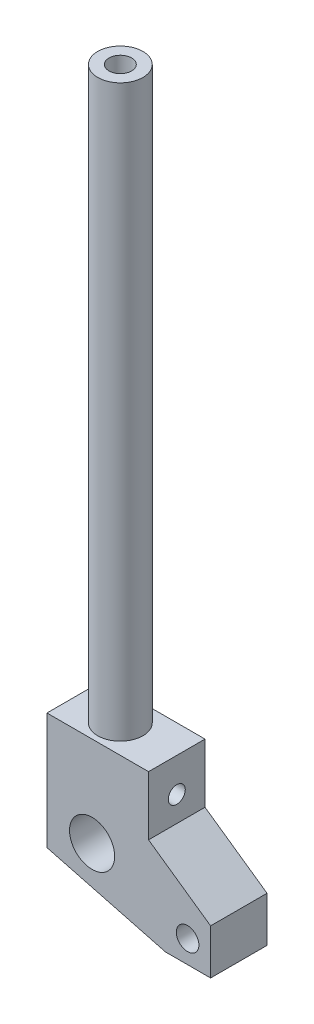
ISO-10303-21;
HEADER;
FILE_DESCRIPTION(('STEP AP214'),'2;1');
FILE_NAME('part.step','',(''),(''),'','','');
FILE_SCHEMA(('AUTOMOTIVE_DESIGN { 1 0 10303 214 1 1 1 1 }'));
ENDSEC;
DATA;
#1=APPLICATION_CONTEXT('core data for automotive mechanical design processes');
#2=APPLICATION_PROTOCOL_DEFINITION('international standard','automotive_design',2000,#1);
#3=PRODUCT_CONTEXT('',#1,'mechanical');
#4=PRODUCT('Part','Part','',(#3));
#5=PRODUCT_RELATED_PRODUCT_CATEGORY('part','',(#4));
#6=PRODUCT_DEFINITION_FORMATION('','',#4);
#7=PRODUCT_DEFINITION_CONTEXT('part definition',#1,'design');
#8=PRODUCT_DEFINITION('design','',#6,#7);
#9=PRODUCT_DEFINITION_SHAPE('','',#8);
#10=(LENGTH_UNIT() NAMED_UNIT(*) SI_UNIT(.MILLI.,.METRE.));
#11=(NAMED_UNIT(*) PLANE_ANGLE_UNIT() SI_UNIT($,.RADIAN.));
#12=(NAMED_UNIT(*) SI_UNIT($,.STERADIAN.) SOLID_ANGLE_UNIT());
#13=UNCERTAINTY_MEASURE_WITH_UNIT(LENGTH_MEASURE(1.E-05),#10,'distance_accuracy_value','');
#14=(GEOMETRIC_REPRESENTATION_CONTEXT(3) GLOBAL_UNCERTAINTY_ASSIGNED_CONTEXT((#13)) GLOBAL_UNIT_ASSIGNED_CONTEXT((#10,
#11,#12)) REPRESENTATION_CONTEXT('',''));
#15=CARTESIAN_POINT('',(0.,0.,0.));
#16=DIRECTION('',(0.,0.,1.));
#17=DIRECTION('',(1.,0.,0.));
#18=AXIS2_PLACEMENT_3D('',#15,#16,#17);
#19=CARTESIAN_POINT('',(0.,185.7248,0.));
#20=DIRECTION('',(0.,1.,0.));
#21=DIRECTION('',(0.,0.,1.));
#22=AXIS2_PLACEMENT_3D('',#19,#20,#21);
#23=PLANE('',#22);
#24=CARTESIAN_POINT('',(0.,185.7248,0.));
#25=DIRECTION('',(0.,1.,0.));
#26=DIRECTION('',(0.,0.,1.));
#27=AXIS2_PLACEMENT_3D('',#24,#25,#26);
#28=CIRCLE('',#27,6.35);
#29=CARTESIAN_POINT('',(0.,185.7248,6.35));
#30=VERTEX_POINT('',#29);
#31=EDGE_CURVE('E14',#30,#30,#28,.T.);
#32=ORIENTED_EDGE('',*,*,#31,.T.);
#33=EDGE_LOOP('',(#32));
#34=FACE_BOUND('',#33,.T.);
#35=CARTESIAN_POINT('',(0.,185.7248,0.));
#36=DIRECTION('',(0.,1.,0.));
#37=DIRECTION('',(1.,0.,0.));
#38=AXIS2_PLACEMENT_3D('',#35,#36,#37);
#39=CIRCLE('',#38,3.175);
#40=CARTESIAN_POINT('',(3.175,185.7248,0.));
#41=VERTEX_POINT('',#40);
#42=EDGE_CURVE('E80',#41,#41,#39,.T.);
#43=ORIENTED_EDGE('',*,*,#42,.F.);
#44=EDGE_LOOP('',(#43));
#45=FACE_BOUND('',#44,.T.);
#46=ADVANCED_FACE('F62',(#34,#45),#23,.T.);
#47=CARTESIAN_POINT('',(0.,7.9248,0.));
#48=DIRECTION('',(0.,1.,0.));
#49=DIRECTION('',(0.,0.,1.));
#50=AXIS2_PLACEMENT_3D('',#47,#48,#49);
#51=PLANE('',#50);
#52=CARTESIAN_POINT('',(0.,7.9248,0.));
#53=DIRECTION('',(0.,1.,0.));
#54=DIRECTION('',(0.,0.,1.));
#55=AXIS2_PLACEMENT_3D('',#52,#53,#54);
#56=CIRCLE('',#55,6.35);
#57=CARTESIAN_POINT('',(0.,7.9248,6.35));
#58=VERTEX_POINT('',#57);
#59=EDGE_CURVE('E75',#58,#58,#56,.T.);
#60=ORIENTED_EDGE('',*,*,#59,.F.);
#61=EDGE_LOOP('',(#60));
#62=FACE_BOUND('',#61,.T.);
#63=CARTESIAN_POINT('',(0.,7.9248,0.));
#64=DIRECTION('',(0.,1.,0.));
#65=DIRECTION('',(1.,0.,0.));
#66=AXIS2_PLACEMENT_3D('',#63,#64,#65);
#67=CIRCLE('',#66,3.175);
#68=CARTESIAN_POINT('',(3.175,7.9248,0.));
#69=VERTEX_POINT('',#68);
#70=EDGE_CURVE('E83',#69,#69,#67,.T.);
#71=ORIENTED_EDGE('',*,*,#70,.T.);
#72=EDGE_LOOP('',(#71));
#73=FACE_BOUND('',#72,.T.);
#74=ADVANCED_FACE('F116',(#62,#73),#51,.F.);
#75=CARTESIAN_POINT('',(0.,185.7248,0.));
#76=DIRECTION('',(0.,-1.,0.));
#77=DIRECTION('',(0.,0.,-1.));
#78=AXIS2_PLACEMENT_3D('',#75,#76,#77);
#79=CYLINDRICAL_SURFACE('',#78,6.35);
#80=CARTESIAN_POINT('',(-6.35,13.4874,0.));
#81=CARTESIAN_POINT('',(-6.3500035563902,13.4873952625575,-0.129280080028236));
#82=CARTESIAN_POINT('',(-6.34601767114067,13.4979328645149,-0.25852780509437));
#83=CARTESIAN_POINT('',(-6.33051572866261,13.5396331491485,-0.513159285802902));
#84=CARTESIAN_POINT('',(-6.31900080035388,13.5707927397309,-0.638543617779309));
#85=CARTESIAN_POINT('',(-6.28967637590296,13.6524782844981,-0.881739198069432));
#86=CARTESIAN_POINT('',(-6.27187906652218,13.7029667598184,-0.999564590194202));
#87=CARTESIAN_POINT('',(-6.23176146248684,13.8216857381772,-1.22506426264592));
#88=CARTESIAN_POINT('',(-6.20943994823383,13.8899210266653,-1.3327357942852));
#89=CARTESIAN_POINT('',(-6.16151302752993,14.045236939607,-1.53946530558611));
#90=CARTESIAN_POINT('',(-6.13581434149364,14.1329414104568,-1.63803276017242));
#91=CARTESIAN_POINT('',(-6.08448730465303,14.3233817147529,-1.8194558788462));
#92=CARTESIAN_POINT('',(-6.05885897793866,14.4261221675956,-1.90230669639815));
#93=CARTESIAN_POINT('',(-6.00948746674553,14.6485206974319,-2.05307244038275));
#94=CARTESIAN_POINT('',(-5.98585422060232,14.7686763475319,-2.12029299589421));
#95=CARTESIAN_POINT('',(-5.94460101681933,15.0196159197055,-2.23335350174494));
#96=CARTESIAN_POINT('',(-5.92697864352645,15.1503955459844,-2.27920204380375));
#97=CARTESIAN_POINT('',(-5.90074022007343,15.4132232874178,-2.34627821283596));
#98=CARTESIAN_POINT('',(-5.8917830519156,15.544997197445,-2.36844231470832));
#99=CARTESIAN_POINT('',(-5.88289143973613,15.810674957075,-2.39044837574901));
#100=CARTESIAN_POINT('',(-5.88295324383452,15.9445778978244,-2.39029961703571));
#101=CARTESIAN_POINT('',(-5.89179859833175,16.2021274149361,-2.36840003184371));
#102=CARTESIAN_POINT('',(-5.90005671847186,16.3259060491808,-2.34795057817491));
#103=CARTESIAN_POINT('',(-5.92349067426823,16.5681253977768,-2.2881821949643));
#104=CARTESIAN_POINT('',(-5.93866755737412,16.6865653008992,-2.24886040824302));
#105=CARTESIAN_POINT('',(-5.97454398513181,16.9173898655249,-2.15175217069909));
#106=CARTESIAN_POINT('',(-5.99534289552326,17.0296169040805,-2.09362938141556));
#107=CARTESIAN_POINT('',(-6.04008702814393,17.243101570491,-1.96080356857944));
#108=CARTESIAN_POINT('',(-6.06403333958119,17.344355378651,-1.88609479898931));
#109=CARTESIAN_POINT('',(-6.11434855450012,17.5402196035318,-1.71627190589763));
#110=CARTESIAN_POINT('',(-6.14077180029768,17.6339183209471,-1.62011983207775));
#111=CARTESIAN_POINT('',(-6.19167271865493,17.8041330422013,-1.41316422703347));
#112=CARTESIAN_POINT('',(-6.21615008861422,17.8806463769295,-1.30235842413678));
#113=CARTESIAN_POINT('',(-6.26089256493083,18.0153311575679,-1.06690505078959));
#114=CARTESIAN_POINT('',(-6.2810859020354,18.0731974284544,-0.942068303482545));
#115=CARTESIAN_POINT('',(-6.31445225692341,18.1668044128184,-0.683483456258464));
#116=CARTESIAN_POINT('',(-6.3276284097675,18.2025550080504,-0.549739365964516));
#117=CARTESIAN_POINT('',(-6.34492392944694,18.2491595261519,-0.284808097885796));
#118=CARTESIAN_POINT('',(-6.34948937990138,18.2612410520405,-0.15386579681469));
#119=CARTESIAN_POINT('',(-6.35042866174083,18.2637409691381,0.108239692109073));
#120=CARTESIAN_POINT('',(-6.34680432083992,18.2541641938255,0.23940282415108));
#121=CARTESIAN_POINT('',(-6.33206545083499,18.2145512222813,0.492911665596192));
#122=CARTESIAN_POINT('',(-6.3212460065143,18.1853205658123,0.615402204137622));
#123=CARTESIAN_POINT('',(-6.29350237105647,18.1082916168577,0.853653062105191));
#124=CARTESIAN_POINT('',(-6.27657738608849,18.0604909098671,0.969412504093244));
#125=CARTESIAN_POINT('',(-6.23767356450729,17.9461525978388,1.19473507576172));
#126=CARTESIAN_POINT('',(-6.21556060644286,17.8791047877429,1.3040154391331));
#127=CARTESIAN_POINT('',(-6.16872471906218,17.7287518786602,1.51014109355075));
#128=CARTESIAN_POINT('',(-6.14400082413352,17.6454407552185,1.60698175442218));
#129=CARTESIAN_POINT('',(-6.0928741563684,17.4592080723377,1.79138858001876));
#130=CARTESIAN_POINT('',(-6.06645757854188,17.3554260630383,1.87808421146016));
#131=CARTESIAN_POINT('',(-6.01631514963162,17.1342695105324,2.03300300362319));
#132=CARTESIAN_POINT('',(-5.99258954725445,17.0168937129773,2.10122445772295));
#133=CARTESIAN_POINT('',(-5.9506092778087,16.7708828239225,2.21734035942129));
#134=CARTESIAN_POINT('',(-5.93237880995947,16.6422010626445,2.26514527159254));
#135=CARTESIAN_POINT('',(-5.90401450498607,16.3777366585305,2.33809198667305));
#136=CARTESIAN_POINT('',(-5.89387562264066,16.2419584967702,2.36324791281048));
#137=CARTESIAN_POINT('',(-5.88351501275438,15.97659407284,2.38891700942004));
#138=CARTESIAN_POINT('',(-5.88269553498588,15.8471736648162,2.39091566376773));
#139=CARTESIAN_POINT('',(-5.88953281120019,15.589944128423,2.37402292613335));
#140=CARTESIAN_POINT('',(-5.89718875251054,15.4621348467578,2.35513353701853));
#141=CARTESIAN_POINT('',(-5.91961554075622,15.2157591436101,2.29815976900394));
#142=CARTESIAN_POINT('',(-5.93415961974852,15.0970292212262,2.26068549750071));
#143=CARTESIAN_POINT('',(-5.96859071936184,14.8674734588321,2.16814441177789));
#144=CARTESIAN_POINT('',(-5.98847909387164,14.7566496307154,2.11307313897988));
#145=CARTESIAN_POINT('',(-6.03265979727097,14.5397109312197,1.98353894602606));
#146=CARTESIAN_POINT('',(-6.05712879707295,14.4341507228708,1.90820810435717));
#147=CARTESIAN_POINT('',(-6.10710789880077,14.236695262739,1.74163375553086));
#148=CARTESIAN_POINT('',(-6.13261833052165,14.1448043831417,1.65038517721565));
#149=CARTESIAN_POINT('',(-6.18347668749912,13.9721869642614,1.44861976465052));
#150=CARTESIAN_POINT('',(-6.20873992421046,13.8923422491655,1.33732365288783));
#151=CARTESIAN_POINT('',(-6.25479380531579,13.7525136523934,1.10200555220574));
#152=CARTESIAN_POINT('',(-6.27558406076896,13.6925314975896,0.977982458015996));
#153=CARTESIAN_POINT('',(-6.31111115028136,13.5923327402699,0.714688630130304));
#154=CARTESIAN_POINT('',(-6.32552900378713,13.5531412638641,0.574980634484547));
#155=CARTESIAN_POINT('',(-6.34496904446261,13.500684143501,0.290166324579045));
#156=CARTESIAN_POINT('',(-6.34999600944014,13.4874053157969,0.14506279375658));
#157=CARTESIAN_POINT('',(-6.35,13.4874,0.));
#158=B_SPLINE_CURVE_WITH_KNOTS('',3,(#80,#81,#82,#83,#84,#85,#86,#87,#88,#89,#90,#91,#92,#93,
#94,#95,#96,#97,#98,#99,#100,#101,#102,#103,#104,#105,#106,#107,#108,#109,#110,#111,#112,#113,
#114,#115,#116,#117,#118,#119,#120,#121,#122,#123,#124,#125,#126,#127,#128,#129,#130,#131,#132,
#133,#134,#135,#136,#137,#138,#139,#140,#141,#142,#143,#144,#145,#146,#147,#148,#149,#150,#151,
#152,#153,#154,#155,#156,#157),.UNSPECIFIED.,.T.,.F.,(4,2,2,2,2,2,2,2,2,2,2,2,2,2,2,2,2,2,2,2,2,
2,2,2,2,2,2,2,2,2,2,2,2,2,2,2,2,2,4),(0.,0.387305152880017,0.774552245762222,1.16105223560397,
1.54765655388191,1.94912928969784,2.35072562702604,2.76771807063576,3.18454273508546,
3.58419585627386,3.98368272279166,4.35911328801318,4.73460070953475,5.11721586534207,
5.49996378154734,5.90858358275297,6.3172668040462,6.73233378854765,7.1472151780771,
7.53994060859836,7.93257840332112,8.31003191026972,8.68753451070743,9.07615126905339,
9.46491225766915,9.87635085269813,10.2878274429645,10.7010904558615,11.1140955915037,
11.5004487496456,11.8867648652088,12.2611638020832,12.6356576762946,13.0298579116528,
13.424183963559,13.8400087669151,14.2558697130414,14.690678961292,15.1252669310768),.UNSPECIFIED.);
#159=CARTESIAN_POINT('',(-6.35,13.4874,0.));
#160=VERTEX_POINT('',#159);
#161=EDGE_CURVE('E106',#160,#160,#158,.T.);
#162=ORIENTED_EDGE('',*,*,#161,.T.);
#163=EDGE_LOOP('',(#162));
#164=FACE_BOUND('',#163,.T.);
#165=CARTESIAN_POINT('',(5.88403486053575,15.875,-2.3876));
#166=CARTESIAN_POINT('',(5.8840302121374,15.7460859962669,-2.38760496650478));
#167=CARTESIAN_POINT('',(5.88831742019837,15.6172046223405,-2.37712460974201));
#168=CARTESIAN_POINT('',(5.90488159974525,15.3633292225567,-2.3356725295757));
#169=CARTESIAN_POINT('',(5.91715829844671,15.2383350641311,-2.30470150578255));
#170=CARTESIAN_POINT('',(5.9481183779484,14.9959718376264,-2.22356632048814));
#171=CARTESIAN_POINT('',(5.96678632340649,14.8785852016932,-2.17344836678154));
#172=CARTESIAN_POINT('',(6.00840055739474,14.6538404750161,-2.0556058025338));
#173=CARTESIAN_POINT('',(6.03134813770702,14.546485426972,-1.98787587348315));
#174=CARTESIAN_POINT('',(6.08022082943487,14.3394860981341,-1.83310682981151));
#175=CARTESIAN_POINT('',(6.10623386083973,14.2404139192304,-1.74533010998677));
#176=CARTESIAN_POINT('',(6.15757319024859,14.0579924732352,-1.55452391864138));
#177=CARTESIAN_POINT('',(6.18289933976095,13.9746465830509,-1.45149117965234));
#178=CARTESIAN_POINT('',(6.2310571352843,13.8232834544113,-1.22875095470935));
#179=CARTESIAN_POINT('',(6.25377369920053,13.7558886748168,-1.10859336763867));
#180=CARTESIAN_POINT('',(6.29309536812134,13.6425072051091,-0.857640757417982));
#181=CARTESIAN_POINT('',(6.30970260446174,13.5965130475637,-0.726849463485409));
#182=CARTESIAN_POINT('',(6.33431024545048,13.5292467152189,-0.464357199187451));
#183=CARTESIAN_POINT('',(6.34265248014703,13.5069894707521,-0.332941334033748));
#184=CARTESIAN_POINT('',(6.35101727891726,13.4846718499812,-0.067992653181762));
#185=CARTESIAN_POINT('',(6.35104256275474,13.4846042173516,0.0655394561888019));
#186=CARTESIAN_POINT('',(6.34298766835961,13.5060954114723,0.323867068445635));
#187=CARTESIAN_POINT('',(6.33531054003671,13.5265788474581,0.448766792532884));
#188=CARTESIAN_POINT('',(6.31324262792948,13.5867809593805,0.693206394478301));
#189=CARTESIAN_POINT('',(6.2988513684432,13.6265009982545,0.812745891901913));
#190=CARTESIAN_POINT('',(6.26451833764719,13.7245453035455,1.04514132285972));
#191=CARTESIAN_POINT('',(6.24449870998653,13.7831323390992,1.15787442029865));
#192=CARTESIAN_POINT('',(6.20093323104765,13.917014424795,1.3721895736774));
#193=CARTESIAN_POINT('',(6.17738623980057,13.9923148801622,1.4737680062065));
#194=CARTESIAN_POINT('',(6.1275575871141,14.1626610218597,1.66922281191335));
#195=CARTESIAN_POINT('',(6.10119653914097,14.2586073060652,1.7622952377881));
#196=CARTESIAN_POINT('',(6.04981621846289,14.4649019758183,1.93133292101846));
#197=CARTESIAN_POINT('',(6.02479728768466,14.5752540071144,2.00729383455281));
#198=CARTESIAN_POINT('',(5.97843203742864,14.8104163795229,2.14149985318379));
#199=CARTESIAN_POINT('',(5.95718062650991,14.9354953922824,2.19930961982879));
#200=CARTESIAN_POINT('',(5.92185475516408,15.1946229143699,2.29274095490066));
#201=CARTESIAN_POINT('',(5.90777627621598,15.3286663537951,2.32837494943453));
#202=CARTESIAN_POINT('',(5.88933940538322,15.5939700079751,2.37460953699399));
#203=CARTESIAN_POINT('',(5.88448561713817,15.7249728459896,2.38648790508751));
#204=CARTESIAN_POINT('',(5.8836450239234,15.9871611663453,2.38856195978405));
#205=CARTESIAN_POINT('',(5.88765598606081,16.1183465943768,2.37876310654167));
#206=CARTESIAN_POINT('',(5.90358963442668,16.370600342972,2.33891959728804));
#207=CARTESIAN_POINT('',(5.91512477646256,16.4918524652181,2.30986558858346));
#208=CARTESIAN_POINT('',(5.94434661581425,16.7277041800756,2.23358445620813));
#209=CARTESIAN_POINT('',(5.96203457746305,16.8423023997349,2.18635359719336));
#210=CARTESIAN_POINT('',(6.00238725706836,17.0663876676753,2.07306114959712));
#211=CARTESIAN_POINT('',(6.0252141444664,17.1755203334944,2.00635808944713));
#212=CARTESIAN_POINT('',(6.07300110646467,17.3814971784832,1.8566961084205));
#213=CARTESIAN_POINT('',(6.0979619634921,17.4783368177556,1.7737312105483));
#214=CARTESIAN_POINT('',(6.14912858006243,17.6633874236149,1.58763854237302));
#215=CARTESIAN_POINT('',(6.17531217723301,17.7506538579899,1.48356215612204));
#216=CARTESIAN_POINT('',(6.22444906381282,17.9065975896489,1.26160107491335));
#217=CARTESIAN_POINT('',(6.24740233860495,17.9752748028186,1.1437163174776));
#218=CARTESIAN_POINT('',(6.28747961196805,18.091645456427,0.897541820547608));
#219=CARTESIAN_POINT('',(6.30462290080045,18.1394084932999,0.769288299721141));
#220=CARTESIAN_POINT('',(6.33120765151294,18.212411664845,0.505774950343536));
#221=CARTESIAN_POINT('',(6.34065275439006,18.2376624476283,0.370518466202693));
#222=CARTESIAN_POINT('',(6.35043029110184,18.2637715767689,0.105373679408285));
#223=CARTESIAN_POINT('',(6.35126394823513,18.2659716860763,-0.0243651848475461));
#224=CARTESIAN_POINT('',(6.34503335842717,18.2493719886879,-0.282285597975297));
#225=CARTESIAN_POINT('',(6.33797007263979,18.2305747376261,-0.410467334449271));
#226=CARTESIAN_POINT('',(6.31696861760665,18.1734567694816,-0.658427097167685));
#227=CARTESIAN_POINT('',(6.3032040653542,18.1356283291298,-0.778334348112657));
#228=CARTESIAN_POINT('',(6.27023909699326,18.0420130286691,-1.01010828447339));
#229=CARTESIAN_POINT('',(6.25103765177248,17.9862227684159,-1.12197344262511));
#230=CARTESIAN_POINT('',(6.20811255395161,17.8555940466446,-1.33965158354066));
#231=CARTESIAN_POINT('',(6.18423243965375,17.7800519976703,-1.44501091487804));
#232=CARTESIAN_POINT('',(6.13488041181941,17.6131713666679,-1.64197119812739));
#233=CARTESIAN_POINT('',(6.10940793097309,17.5218271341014,-1.73356720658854));
#234=CARTESIAN_POINT('',(6.05808407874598,17.3201658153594,-1.90541077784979));
#235=CARTESIAN_POINT('',(6.03228447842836,17.2090985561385,-1.98479686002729));
#236=CARTESIAN_POINT('',(5.98475799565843,16.9743855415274,-2.1238148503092));
#237=CARTESIAN_POINT('',(5.96303157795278,16.850738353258,-2.1834445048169));
#238=CARTESIAN_POINT('',(5.92561025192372,16.5881574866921,-2.28312063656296));
#239=CARTESIAN_POINT('',(5.91023985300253,16.4487817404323,-2.32213671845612));
#240=CARTESIAN_POINT('',(5.88945810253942,16.1645878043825,-2.37436496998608));
#241=CARTESIAN_POINT('',(5.88404008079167,16.0197733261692,-2.38759442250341));
#242=CARTESIAN_POINT('',(5.88403486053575,15.875,-2.3876));
#243=B_SPLINE_CURVE_WITH_KNOTS('',3,(#165,#166,#167,#168,#169,#170,#171,#172,#173,#174,#175,
#176,#177,#178,#179,#180,#181,#182,#183,#184,#185,#186,#187,#188,#189,#190,#191,#192,#193,#194,
#195,#196,#197,#198,#199,#200,#201,#202,#203,#204,#205,#206,#207,#208,#209,#210,#211,#212,#213,
#214,#215,#216,#217,#218,#219,#220,#221,#222,#223,#224,#225,#226,#227,#228,#229,#230,#231,#232,
#233,#234,#235,#236,#237,#238,#239,#240,#241,#242),.UNSPECIFIED.,.T.,.F.,(4,2,2,2,2,2,2,2,2,2,2,
2,2,2,2,2,2,2,2,2,2,2,2,2,2,2,2,2,2,2,2,2,2,2,2,2,2,2,4),(0.,0.386202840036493,
0.772392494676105,1.15765597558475,1.54303593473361,1.94592885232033,2.34890818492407,
2.76568347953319,3.18231323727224,3.58088601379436,3.97932845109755,4.35795497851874,
4.73660833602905,5.12078165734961,5.50507940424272,5.91197121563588,6.31896620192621,
6.73508539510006,7.15097120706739,7.54381120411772,7.93655226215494,8.31051085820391,
8.68454634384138,9.0726506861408,9.46089794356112,9.87391247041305,10.2869288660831,
10.6985602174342,11.10999676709,11.4973408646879,11.8846378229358,12.2623954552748,
12.6402246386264,13.0339746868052,13.4278658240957,13.8426840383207,14.257549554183,
14.6915550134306,15.1252694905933),.UNSPECIFIED.);
#244=CARTESIAN_POINT('',(5.88403486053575,15.875,-2.3876));
#245=VERTEX_POINT('',#244);
#246=EDGE_CURVE('E102',#245,#245,#243,.T.);
#247=ORIENTED_EDGE('',*,*,#246,.T.);
#248=EDGE_LOOP('',(#247));
#249=FACE_BOUND('',#248,.T.);
#250=ORIENTED_EDGE('',*,*,#31,.F.);
#251=EDGE_LOOP('',(#250));
#252=FACE_BOUND('',#251,.T.);
#253=ORIENTED_EDGE('',*,*,#59,.T.);
#254=EDGE_LOOP('',(#253));
#255=FACE_BOUND('',#254,.T.);
#256=ADVANCED_FACE('F64',(#164,#249,#252,#255),#79,.T.);
#257=CARTESIAN_POINT('',(0.,185.7248,0.));
#258=DIRECTION('',(0.,-1.,0.));
#259=DIRECTION('',(0.,0.,-1.));
#260=AXIS2_PLACEMENT_3D('',#257,#258,#259);
#261=CYLINDRICAL_SURFACE('',#260,3.175);
#262=CARTESIAN_POINT('',(-2.09284286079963,15.875,-2.3876));
#263=CARTESIAN_POINT('',(-2.0928374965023,15.9306786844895,-2.38760258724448));
#264=CARTESIAN_POINT('',(-2.09507658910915,15.9863376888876,-2.38564754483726));
#265=CARTESIAN_POINT('',(-2.10386546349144,16.0970530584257,-2.37790004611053));
#266=CARTESIAN_POINT('',(-2.11041659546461,16.1521092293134,-2.37210638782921));
#267=CARTESIAN_POINT('',(-2.13604854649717,16.315781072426,-2.34914183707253));
#268=CARTESIAN_POINT('',(-2.16110615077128,16.4227305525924,-2.32638804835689));
#269=CARTESIAN_POINT('',(-2.22198765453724,16.6278636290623,-2.26828170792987));
#270=CARTESIAN_POINT('',(-2.2576568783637,16.7261484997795,-2.23310888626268));
#271=CARTESIAN_POINT('',(-2.33546808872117,16.9151029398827,-2.15160353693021));
#272=CARTESIAN_POINT('',(-2.37760919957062,17.0057735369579,-2.10527251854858));
#273=CARTESIAN_POINT('',(-2.47416130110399,17.1977895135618,-1.99143586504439));
#274=CARTESIAN_POINT('',(-2.52928516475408,17.2973509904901,-1.92152511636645));
#275=CARTESIAN_POINT('',(-2.63935252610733,17.4849502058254,-1.76733440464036));
#276=CARTESIAN_POINT('',(-2.69429563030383,17.5729704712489,-1.68303308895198));
#277=CARTESIAN_POINT('',(-2.81101882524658,17.7531571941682,-1.48153014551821));
#278=CARTESIAN_POINT('',(-2.87187869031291,17.8424484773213,-1.36112812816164));
#279=CARTESIAN_POINT('',(-2.95370443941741,17.9594987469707,-1.16671330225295));
#280=CARTESIAN_POINT('',(-2.9793945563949,17.9956907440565,-1.09963388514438));
#281=CARTESIAN_POINT('',(-3.02688648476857,18.0619126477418,-0.961212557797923));
#282=CARTESIAN_POINT('',(-3.04869036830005,18.0919458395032,-0.889872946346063));
#283=CARTESIAN_POINT('',(-3.09531866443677,18.1557130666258,-0.714659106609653));
#284=CARTESIAN_POINT('',(-3.1179685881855,18.1862714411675,-0.609007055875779));
#285=CARTESIAN_POINT('',(-3.15249630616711,18.2326433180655,-0.392876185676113));
#286=CARTESIAN_POINT('',(-3.16438348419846,18.2484696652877,-0.28240165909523));
#287=CARTESIAN_POINT('',(-3.17641237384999,18.2644839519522,-0.0593700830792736));
#288=CARTESIAN_POINT('',(-3.17652323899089,18.2646308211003,0.0531916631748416));
#289=CARTESIAN_POINT('',(-3.16490643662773,18.2491665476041,0.276610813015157));
#290=CARTESIAN_POINT('',(-3.15317605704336,18.233551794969,0.387467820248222));
#291=CARTESIAN_POINT('',(-3.11949894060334,18.1883308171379,0.600490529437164));
#292=CARTESIAN_POINT('',(-3.0979211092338,18.1592292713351,0.702824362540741));
#293=CARTESIAN_POINT('',(-3.04625270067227,18.0886487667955,0.900805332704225));
#294=CARTESIAN_POINT('',(-3.01616025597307,18.0471670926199,0.996450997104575));
#295=CARTESIAN_POINT('',(-2.94569845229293,17.9482784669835,1.18960754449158));
#296=CARTESIAN_POINT('',(-2.90457003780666,17.889635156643,1.28620352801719));
#297=CARTESIAN_POINT('',(-2.81675805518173,17.7608302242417,1.46859317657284));
#298=CARTESIAN_POINT('',(-2.77006981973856,17.690658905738,1.55437763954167));
#299=CARTESIAN_POINT('',(-2.66431988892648,17.5252850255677,1.73047298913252));
#300=CARTESIAN_POINT('',(-2.60463436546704,17.4278753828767,1.81833753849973));
#301=CARTESIAN_POINT('',(-2.48609807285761,17.219639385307,1.97731039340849));
#302=CARTESIAN_POINT('',(-2.42724773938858,17.1088062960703,2.04841023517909));
#303=CARTESIAN_POINT('',(-2.32756293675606,16.8970027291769,2.16045341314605));
#304=CARTESIAN_POINT('',(-2.28545277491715,16.7983208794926,2.20457350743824));
#305=CARTESIAN_POINT('',(-2.21047371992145,16.5928343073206,2.27974861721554));
#306=CARTESIAN_POINT('',(-2.17758400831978,16.4860485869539,2.31083314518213));
#307=CARTESIAN_POINT('',(-2.13149035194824,16.2879796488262,2.3533302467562));
#308=CARTESIAN_POINT('',(-2.11565547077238,16.1979069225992,2.3674442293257));
#309=CARTESIAN_POINT('',(-2.09560440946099,16.0154988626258,2.38521714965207));
#310=CARTESIAN_POINT('',(-2.09137290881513,15.9231666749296,2.38888987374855));
#311=CARTESIAN_POINT('',(-2.09523583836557,15.7389251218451,2.38550089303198));
#312=CARTESIAN_POINT('',(-2.1033368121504,15.6470160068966,2.37843348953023));
#313=CARTESIAN_POINT('',(-2.13051488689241,15.4661673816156,2.35411336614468));
#314=CARTESIAN_POINT('',(-2.14961081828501,15.3772332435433,2.33684317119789));
#315=CARTESIAN_POINT('',(-2.20483310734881,15.1718532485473,2.28500124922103));
#316=CARTESIAN_POINT('',(-2.24464944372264,15.0574425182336,2.24638762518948));
#317=CARTESIAN_POINT('',(-2.33324659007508,14.8385975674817,2.1542223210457));
#318=CARTESIAN_POINT('',(-2.3820439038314,14.734182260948,2.10064304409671));
#319=CARTESIAN_POINT('',(-2.48514559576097,14.5319545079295,1.97771133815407));
#320=CARTESIAN_POINT('',(-2.5395850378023,14.4345154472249,1.90786021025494));
#321=CARTESIAN_POINT('',(-2.64801658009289,14.2509706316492,1.75428253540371));
#322=CARTESIAN_POINT('',(-2.70200844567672,14.1648705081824,1.67054914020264));
#323=CARTESIAN_POINT('',(-2.81757394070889,13.9870726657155,1.46907410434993));
#324=CARTESIAN_POINT('',(-2.87812664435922,13.8984613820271,1.34791819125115));
#325=CARTESIAN_POINT('',(-2.95931983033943,13.7825560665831,1.1524121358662));
#326=CARTESIAN_POINT('',(-2.98477313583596,13.7467629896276,1.08496649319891));
#327=CARTESIAN_POINT('',(-3.03173057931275,13.6813911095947,0.945841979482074));
#328=CARTESIAN_POINT('',(-3.05323685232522,13.6518089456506,0.874165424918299));
#329=CARTESIAN_POINT('',(-3.09900678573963,13.5892901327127,0.698493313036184));
#330=CARTESIAN_POINT('',(-3.12109438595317,13.5595170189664,0.592762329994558));
#331=CARTESIAN_POINT('',(-3.1544741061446,13.5147162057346,0.376639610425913));
#332=CARTESIAN_POINT('',(-3.16577600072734,13.4996751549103,0.266252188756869));
#333=CARTESIAN_POINT('',(-3.17666061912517,13.4851871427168,0.0435828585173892));
#334=CARTESIAN_POINT('',(-3.17621422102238,13.4857789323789,-0.0687030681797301));
#335=CARTESIAN_POINT('',(-3.16356553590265,13.5026202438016,-0.291425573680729));
#336=CARTESIAN_POINT('',(-3.15136027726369,13.5188737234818,-0.401861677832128));
#337=CARTESIAN_POINT('',(-3.11680766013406,13.565296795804,-0.614298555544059));
#338=CARTESIAN_POINT('',(-3.09479330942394,13.5950099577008,-0.716455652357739));
#339=CARTESIAN_POINT('',(-3.0423179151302,13.6667644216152,-0.9139939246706));
#340=CARTESIAN_POINT('',(-3.01185504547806,13.7088083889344,-1.0093736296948));
#341=CARTESIAN_POINT('',(-2.9405932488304,13.8089710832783,-1.20218154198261));
#342=CARTESIAN_POINT('',(-2.89902224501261,13.8683562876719,-1.2986613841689));
#343=CARTESIAN_POINT('',(-2.81040458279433,13.9986564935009,-1.48071720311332));
#344=CARTESIAN_POINT('',(-2.76335310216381,14.06958167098,-1.5662834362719));
#345=CARTESIAN_POINT('',(-2.65689512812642,14.2366890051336,-1.74184987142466));
#346=CARTESIAN_POINT('',(-2.59688698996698,14.3350914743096,-1.82937326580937));
#347=CARTESIAN_POINT('',(-2.47795998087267,14.5453951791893,-1.98748777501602));
#348=CARTESIAN_POINT('',(-2.41904160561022,14.6573023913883,-2.05807135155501));
#349=CARTESIAN_POINT('',(-2.3202469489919,14.8697791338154,-2.16826612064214));
#350=CARTESIAN_POINT('',(-2.2789497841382,14.9679252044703,-2.21126288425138));
#351=CARTESIAN_POINT('',(-2.20567836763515,15.172129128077,-2.28435835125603));
#352=CARTESIAN_POINT('',(-2.17368027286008,15.2781658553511,-2.3144901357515));
#353=CARTESIAN_POINT('',(-2.13099123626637,15.4662974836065,-2.35374144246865));
#354=CARTESIAN_POINT('',(-2.11685160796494,15.5468707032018,-2.3663715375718));
#355=CARTESIAN_POINT('',(-2.09778514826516,15.709978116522,-2.38329550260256));
#356=CARTESIAN_POINT('',(-2.09285080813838,15.7925106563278,-2.38759616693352));
#357=CARTESIAN_POINT('',(-2.09284286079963,15.875,-2.3876));
#358=B_SPLINE_CURVE_WITH_KNOTS('',3,(#262,#263,#264,#265,#266,#267,#268,#269,#270,#271,#272,
#273,#274,#275,#276,#277,#278,#279,#280,#281,#282,#283,#284,#285,#286,#287,#288,#289,#290,#291,
#292,#293,#294,#295,#296,#297,#298,#299,#300,#301,#302,#303,#304,#305,#306,#307,#308,#309,#310,
#311,#312,#313,#314,#315,#316,#317,#318,#319,#320,#321,#322,#323,#324,#325,#326,#327,#328,#329,
#330,#331,#332,#333,#334,#335,#336,#337,#338,#339,#340,#341,#342,#343,#344,#345,#346,#347,#348,
#349,#350,#351,#352,#353,#354,#355,#356,#357),.UNSPECIFIED.,.T.,.F.,(4,2,2,2,2,2,2,2,2,2,2,2,2,
2,2,2,2,2,2,2,2,2,2,2,2,2,2,2,2,2,2,2,2,2,2,2,2,2,2,2,2,2,2,2,2,2,2,4),(0.,0.166920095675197,
0.333892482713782,0.668336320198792,0.99812605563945,1.32787120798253,1.72718704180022,
2.12710061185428,2.60932240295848,2.85025428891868,3.0910573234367,3.42639300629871,
3.76143603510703,4.0973566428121,4.43335420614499,4.75768432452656,5.08208563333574,
5.44153491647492,5.80128810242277,6.23202113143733,6.66297115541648,7.00991940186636,
7.35607786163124,7.63250418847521,7.90856535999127,8.18477306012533,8.46145521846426,
8.84079358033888,9.22083611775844,9.61456988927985,10.0084984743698,10.4909072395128,
10.7319922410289,10.9729464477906,11.307534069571,11.6418181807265,11.9769310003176,
12.3121285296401,12.6367236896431,12.9613890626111,13.322102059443,13.6831348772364,
14.1156545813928,14.5483664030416,14.8918136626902,15.2343723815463,15.4818705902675,
15.7291668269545),.UNSPECIFIED.);
#359=CARTESIAN_POINT('',(-2.09284286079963,15.875,-2.3876));
#360=VERTEX_POINT('',#359);
#361=EDGE_CURVE('E67',#360,#360,#358,.T.);
#362=ORIENTED_EDGE('',*,*,#361,.F.);
#363=EDGE_LOOP('',(#362));
#364=FACE_BOUND('',#363,.T.);
#365=CARTESIAN_POINT('',(2.09284286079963,15.875,-2.3876));
#366=CARTESIAN_POINT('',(2.0928374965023,15.8193213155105,-2.38760258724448));
#367=CARTESIAN_POINT('',(2.09507658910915,15.7636623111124,-2.38564754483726));
#368=CARTESIAN_POINT('',(2.10386546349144,15.6529469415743,-2.37790004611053));
#369=CARTESIAN_POINT('',(2.11041659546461,15.5978907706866,-2.37210638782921));
#370=CARTESIAN_POINT('',(2.13604854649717,15.434218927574,-2.34914183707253));
#371=CARTESIAN_POINT('',(2.16110615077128,15.3272694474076,-2.32638804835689));
#372=CARTESIAN_POINT('',(2.22198765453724,15.1221363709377,-2.26828170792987));
#373=CARTESIAN_POINT('',(2.2576568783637,15.0238515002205,-2.23310888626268));
#374=CARTESIAN_POINT('',(2.33546808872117,14.8348970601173,-2.15160353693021));
#375=CARTESIAN_POINT('',(2.37760919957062,14.7442264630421,-2.10527251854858));
#376=CARTESIAN_POINT('',(2.47416130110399,14.5522104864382,-1.99143586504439));
#377=CARTESIAN_POINT('',(2.52928516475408,14.4526490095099,-1.92152511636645));
#378=CARTESIAN_POINT('',(2.63935252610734,14.2650497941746,-1.76733440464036));
#379=CARTESIAN_POINT('',(2.69429563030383,14.1770295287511,-1.68303308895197));
#380=CARTESIAN_POINT('',(2.81101882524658,13.9968428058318,-1.4815301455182));
#381=CARTESIAN_POINT('',(2.87187869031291,13.9075515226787,-1.36112812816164));
#382=CARTESIAN_POINT('',(2.95370443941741,13.7905012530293,-1.16671330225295));
#383=CARTESIAN_POINT('',(2.9793945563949,13.7543092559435,-1.09963388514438));
#384=CARTESIAN_POINT('',(3.02688648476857,13.6880873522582,-0.961212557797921));
#385=CARTESIAN_POINT('',(3.04869036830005,13.6580541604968,-0.88987294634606));
#386=CARTESIAN_POINT('',(3.09531866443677,13.5942869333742,-0.714659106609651));
#387=CARTESIAN_POINT('',(3.1179685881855,13.5637285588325,-0.609007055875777));
#388=CARTESIAN_POINT('',(3.15249630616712,13.5173566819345,-0.392876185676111));
#389=CARTESIAN_POINT('',(3.16438348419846,13.5015303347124,-0.282401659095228));
#390=CARTESIAN_POINT('',(3.17641237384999,13.4855160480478,-0.0593700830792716));
#391=CARTESIAN_POINT('',(3.17652323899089,13.4853691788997,0.0531916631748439));
#392=CARTESIAN_POINT('',(3.16490643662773,13.5008334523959,0.27661081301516));
#393=CARTESIAN_POINT('',(3.15317605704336,13.516448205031,0.387467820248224));
#394=CARTESIAN_POINT('',(3.11949894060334,13.5616691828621,0.600490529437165));
#395=CARTESIAN_POINT('',(3.09792110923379,13.5907707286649,0.702824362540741));
#396=CARTESIAN_POINT('',(3.04625270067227,13.6613512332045,0.900805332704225));
#397=CARTESIAN_POINT('',(3.01616025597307,13.7028329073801,0.996450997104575));
#398=CARTESIAN_POINT('',(2.94569845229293,13.8017215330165,1.18960754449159));
#399=CARTESIAN_POINT('',(2.90457003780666,13.860364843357,1.28620352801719));
#400=CARTESIAN_POINT('',(2.81675805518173,13.9891697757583,1.46859317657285));
#401=CARTESIAN_POINT('',(2.77006981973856,14.059341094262,1.55437763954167));
#402=CARTESIAN_POINT('',(2.66431988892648,14.2247149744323,1.73047298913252));
#403=CARTESIAN_POINT('',(2.60463436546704,14.3221246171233,1.81833753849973));
#404=CARTESIAN_POINT('',(2.48609807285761,14.530360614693,1.97731039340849));
#405=CARTESIAN_POINT('',(2.42724773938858,14.6411937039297,2.04841023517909));
#406=CARTESIAN_POINT('',(2.32756293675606,14.8529972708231,2.16045341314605));
#407=CARTESIAN_POINT('',(2.28545277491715,14.9516791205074,2.20457350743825));
#408=CARTESIAN_POINT('',(2.21047371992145,15.1571656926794,2.27974861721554));
#409=CARTESIAN_POINT('',(2.17758400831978,15.2639514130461,2.31083314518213));
#410=CARTESIAN_POINT('',(2.13149035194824,15.4620203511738,2.3533302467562));
#411=CARTESIAN_POINT('',(2.11565547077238,15.5520930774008,2.3674442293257));
#412=CARTESIAN_POINT('',(2.09560440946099,15.7345011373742,2.38521714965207));
#413=CARTESIAN_POINT('',(2.09137290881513,15.8268333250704,2.38888987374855));
#414=CARTESIAN_POINT('',(2.09523583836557,16.0110748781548,2.38550089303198));
#415=CARTESIAN_POINT('',(2.1033368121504,16.1029839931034,2.37843348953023));
#416=CARTESIAN_POINT('',(2.13051488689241,16.2838326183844,2.35411336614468));
#417=CARTESIAN_POINT('',(2.14961081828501,16.3727667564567,2.33684317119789));
#418=CARTESIAN_POINT('',(2.20483310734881,16.5781467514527,2.28500124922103));
#419=CARTESIAN_POINT('',(2.24464944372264,16.6925574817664,2.24638762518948));
#420=CARTESIAN_POINT('',(2.33324659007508,16.9114024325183,2.15422232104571));
#421=CARTESIAN_POINT('',(2.3820439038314,17.015817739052,2.10064304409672));
#422=CARTESIAN_POINT('',(2.48514559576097,17.2180454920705,1.97771133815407));
#423=CARTESIAN_POINT('',(2.53958503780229,17.3154845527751,1.90786021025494));
#424=CARTESIAN_POINT('',(2.64801658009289,17.4990293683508,1.75428253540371));
#425=CARTESIAN_POINT('',(2.70200844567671,17.5851294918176,1.67054914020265));
#426=CARTESIAN_POINT('',(2.81757394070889,17.7629273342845,1.46907410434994));
#427=CARTESIAN_POINT('',(2.87812664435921,17.8515386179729,1.34791819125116));
#428=CARTESIAN_POINT('',(2.95931983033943,17.9674439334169,1.15241213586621));
#429=CARTESIAN_POINT('',(2.98477313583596,18.0032370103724,1.08496649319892));
#430=CARTESIAN_POINT('',(3.03173057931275,18.0686088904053,0.945841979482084));
#431=CARTESIAN_POINT('',(3.05323685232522,18.0981910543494,0.874165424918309));
#432=CARTESIAN_POINT('',(3.09900678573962,18.1607098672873,0.698493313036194));
#433=CARTESIAN_POINT('',(3.12109438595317,18.1904829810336,0.592762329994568));
#434=CARTESIAN_POINT('',(3.1544741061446,18.2352837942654,0.376639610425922));
#435=CARTESIAN_POINT('',(3.16577600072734,18.2503248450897,0.266252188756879));
#436=CARTESIAN_POINT('',(3.17666061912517,18.2648128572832,0.0435828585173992));
#437=CARTESIAN_POINT('',(3.17621422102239,18.2642210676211,-0.0687030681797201));
#438=CARTESIAN_POINT('',(3.16356553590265,18.2473797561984,-0.291425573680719));
#439=CARTESIAN_POINT('',(3.15136027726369,18.2311262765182,-0.401861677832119));
#440=CARTESIAN_POINT('',(3.11680766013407,18.184703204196,-0.614298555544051));
#441=CARTESIAN_POINT('',(3.09479330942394,18.1549900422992,-0.71645565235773));
#442=CARTESIAN_POINT('',(3.0423179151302,18.0832355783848,-0.913993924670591));
#443=CARTESIAN_POINT('',(3.01185504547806,18.0411916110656,-1.0093736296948));
#444=CARTESIAN_POINT('',(2.9405932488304,17.9410289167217,-1.2021815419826));
#445=CARTESIAN_POINT('',(2.89902224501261,17.8816437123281,-1.29866138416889));
#446=CARTESIAN_POINT('',(2.81040458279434,17.7513435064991,-1.48071720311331));
#447=CARTESIAN_POINT('',(2.76335310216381,17.68041832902,-1.56628343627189));
#448=CARTESIAN_POINT('',(2.65689512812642,17.5133109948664,-1.74184987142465));
#449=CARTESIAN_POINT('',(2.59688698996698,17.4149085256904,-1.82937326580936));
#450=CARTESIAN_POINT('',(2.47795998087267,17.2046048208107,-1.98748777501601));
#451=CARTESIAN_POINT('',(2.41904160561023,17.0926976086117,-2.05807135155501));
#452=CARTESIAN_POINT('',(2.32024694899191,16.8802208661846,-2.16826612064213));
#453=CARTESIAN_POINT('',(2.27894978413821,16.7820747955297,-2.21126288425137));
#454=CARTESIAN_POINT('',(2.20567836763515,16.577870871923,-2.28435835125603));
#455=CARTESIAN_POINT('',(2.17368027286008,16.4718341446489,-2.3144901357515));
#456=CARTESIAN_POINT('',(2.13099123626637,16.2837025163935,-2.35374144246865));
#457=CARTESIAN_POINT('',(2.11685160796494,16.2031292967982,-2.3663715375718));
#458=CARTESIAN_POINT('',(2.09778514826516,16.040021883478,-2.38329550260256));
#459=CARTESIAN_POINT('',(2.09285080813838,15.9574893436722,-2.38759616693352));
#460=CARTESIAN_POINT('',(2.09284286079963,15.875,-2.3876));
#461=B_SPLINE_CURVE_WITH_KNOTS('',3,(#365,#366,#367,#368,#369,#370,#371,#372,#373,#374,#375,
#376,#377,#378,#379,#380,#381,#382,#383,#384,#385,#386,#387,#388,#389,#390,#391,#392,#393,#394,
#395,#396,#397,#398,#399,#400,#401,#402,#403,#404,#405,#406,#407,#408,#409,#410,#411,#412,#413,
#414,#415,#416,#417,#418,#419,#420,#421,#422,#423,#424,#425,#426,#427,#428,#429,#430,#431,#432,
#433,#434,#435,#436,#437,#438,#439,#440,#441,#442,#443,#444,#445,#446,#447,#448,#449,#450,#451,
#452,#453,#454,#455,#456,#457,#458,#459,#460),.UNSPECIFIED.,.T.,.F.,(4,2,2,2,2,2,2,2,2,2,2,2,2,
2,2,2,2,2,2,2,2,2,2,2,2,2,2,2,2,2,2,2,2,2,2,2,2,2,2,2,2,2,2,2,2,2,2,4),(0.,0.166920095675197,
0.33389248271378,0.668336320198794,0.998126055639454,1.32787120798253,1.72718704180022,
2.12710061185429,2.60932240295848,2.85025428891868,3.0910573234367,3.42639300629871,
3.76143603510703,4.0973566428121,4.43335420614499,4.75768432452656,5.08208563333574,
5.44153491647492,5.80128810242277,6.23202113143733,6.66297115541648,7.00991940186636,
7.35607786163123,7.6325041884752,7.90856535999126,8.18477306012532,8.46145521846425,
8.84079358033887,9.22083611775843,9.61456988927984,10.0084984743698,10.4909072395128,
10.7319922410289,10.9729464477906,11.307534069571,11.6418181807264,11.9769310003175,
12.3121285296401,12.636723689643,12.9613890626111,13.322102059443,13.6831348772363,
14.1156545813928,14.5483664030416,14.8918136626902,15.2343723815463,15.4818705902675,
15.7291668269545),.UNSPECIFIED.);
#462=CARTESIAN_POINT('',(2.09284286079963,15.875,-2.3876));
#463=VERTEX_POINT('',#462);
#464=EDGE_CURVE('E85',#463,#463,#461,.T.);
#465=ORIENTED_EDGE('',*,*,#464,.F.);
#466=EDGE_LOOP('',(#465));
#467=FACE_BOUND('',#466,.T.);
#468=ORIENTED_EDGE('',*,*,#42,.T.);
#469=EDGE_LOOP('',(#468));
#470=FACE_BOUND('',#469,.T.);
#471=ORIENTED_EDGE('',*,*,#70,.F.);
#472=EDGE_LOOP('',(#471));
#473=FACE_BOUND('',#472,.T.);
#474=ADVANCED_FACE('F89',(#364,#467,#470,#473),#261,.F.);
#475=CARTESIAN_POINT('',(-6.35,15.875,0.));
#476=DIRECTION('',(1.,0.,0.));
#477=DIRECTION('',(0.,0.,-1.));
#478=AXIS2_PLACEMENT_3D('',#475,#476,#477);
#479=CYLINDRICAL_SURFACE('',#478,2.3876);
#480=ORIENTED_EDGE('',*,*,#464,.T.);
#481=EDGE_LOOP('',(#480));
#482=FACE_BOUND('',#481,.T.);
#483=ORIENTED_EDGE('',*,*,#246,.F.);
#484=EDGE_LOOP('',(#483));
#485=FACE_BOUND('',#484,.T.);
#486=ADVANCED_FACE('F95',(#482,#485),#479,.F.);
#487=ORIENTED_EDGE('',*,*,#361,.T.);
#488=EDGE_LOOP('',(#487));
#489=FACE_BOUND('',#488,.T.);
#490=ORIENTED_EDGE('',*,*,#161,.F.);
#491=EDGE_LOOP('',(#490));
#492=FACE_BOUND('',#491,.T.);
#493=ADVANCED_FACE('F92',(#489,#492),#479,.F.);
#494=CLOSED_SHELL('',(#46,#74,#256,#474,#486,#493));
#495=MANIFOLD_SOLID_BREP('B2',#494);
#496=CARTESIAN_POINT('',(15.875,25.4,7.9375));
#497=DIRECTION('',(-1.,0.,0.));
#498=DIRECTION('',(0.,-1.,0.));
#499=AXIS2_PLACEMENT_3D('',#496,#497,#498);
#500=PLANE('',#499);
#501=DIRECTION('',(0.,1.,0.));
#502=VECTOR('',#501,1.);
#503=CARTESIAN_POINT('',(15.875,25.4,-7.9375));
#504=LINE('',#503,#502);
#505=CARTESIAN_POINT('',(15.875,8.78948150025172,-7.9375));
#506=VERTEX_POINT('',#505);
#507=CARTESIAN_POINT('',(15.875,25.4,-7.9375));
#508=VERTEX_POINT('',#507);
#509=EDGE_CURVE('E286',#506,#508,#504,.T.);
#510=ORIENTED_EDGE('',*,*,#509,.T.);
#511=DIRECTION('',(0.,0.,-1.));
#512=VECTOR('',#511,1.);
#513=CARTESIAN_POINT('',(15.875,25.4,7.9375));
#514=LINE('',#513,#512);
#515=CARTESIAN_POINT('',(15.875,25.4,7.9375));
#516=VERTEX_POINT('',#515);
#517=EDGE_CURVE('E297',#516,#508,#514,.T.);
#518=ORIENTED_EDGE('',*,*,#517,.F.);
#519=DIRECTION('',(0.,1.,0.));
#520=VECTOR('',#519,1.);
#521=CARTESIAN_POINT('',(15.875,25.4,7.9375));
#522=LINE('',#521,#520);
#523=CARTESIAN_POINT('',(15.875,8.78948150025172,7.9375));
#524=VERTEX_POINT('',#523);
#525=EDGE_CURVE('E361',#524,#516,#522,.T.);
#526=ORIENTED_EDGE('',*,*,#525,.F.);
#527=DIRECTION('',(0.,0.,-1.));
#528=VECTOR('',#527,1.);
#529=CARTESIAN_POINT('',(15.875,8.78948150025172,7.9375));
#530=LINE('',#529,#528);
#531=EDGE_CURVE('E196',#524,#506,#530,.T.);
#532=ORIENTED_EDGE('',*,*,#531,.T.);
#533=EDGE_LOOP('',(#510,#518,#526,#532));
#534=FACE_BOUND('',#533,.T.);
#535=CARTESIAN_POINT('',(15.875,15.875,0.));
#536=DIRECTION('',(-1.,0.,0.));
#537=DIRECTION('',(0.,-1.,0.));
#538=AXIS2_PLACEMENT_3D('',#535,#536,#537);
#539=CIRCLE('',#538,2.3876);
#540=CARTESIAN_POINT('',(15.875,13.4874,0.));
#541=VERTEX_POINT('',#540);
#542=EDGE_CURVE('E312',#541,#541,#539,.F.);
#543=ORIENTED_EDGE('',*,*,#542,.F.);
#544=EDGE_LOOP('',(#543));
#545=FACE_BOUND('',#544,.T.);
#546=ADVANCED_FACE('F186',(#534,#545),#500,.F.);
#547=CARTESIAN_POINT('',(0.,33.3248,0.));
#548=DIRECTION('',(0.,-1.,0.));
#549=DIRECTION('',(0.,0.,-1.));
#550=AXIS2_PLACEMENT_3D('',#547,#548,#549);
#551=CYLINDRICAL_SURFACE('',#550,6.35);
#552=CARTESIAN_POINT('',(-4.96204456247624,15.875,-3.9624));
#553=CARTESIAN_POINT('',(-4.9620461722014,15.9735542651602,-3.96239898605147));
#554=CARTESIAN_POINT('',(-4.96499361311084,16.072128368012,-3.95871565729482));
#555=CARTESIAN_POINT('',(-4.97665132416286,16.2684299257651,-3.94404942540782));
#556=CARTESIAN_POINT('',(-4.98536502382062,16.3661568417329,-3.93306217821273));
#557=CARTESIAN_POINT('',(-5.00818997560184,16.5601069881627,-3.90395628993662));
#558=CARTESIAN_POINT('',(-5.02231220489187,16.6563267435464,-3.88582314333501));
#559=CARTESIAN_POINT('',(-5.05536542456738,16.8463972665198,-3.84272223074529));
#560=CARTESIAN_POINT('',(-5.07429881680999,16.9402468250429,-3.81775105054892));
#561=CARTESIAN_POINT('',(-5.13688938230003,17.2156937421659,-3.73359578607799));
#562=CARTESIAN_POINT('',(-5.18658530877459,17.393097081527,-3.66487361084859));
#563=CARTESIAN_POINT('',(-5.29621726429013,17.7335291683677,-3.50456501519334));
#564=CARTESIAN_POINT('',(-5.35615351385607,17.8965576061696,-3.41297810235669));
#565=CARTESIAN_POINT('',(-5.48917972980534,18.2276930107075,-3.19527444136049));
#566=CARTESIAN_POINT('',(-5.56295702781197,18.3935658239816,-3.06617851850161));
#567=CARTESIAN_POINT('',(-5.70984401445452,18.7032555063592,-2.7830912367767));
#568=CARTESIAN_POINT('',(-5.78295307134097,18.8470531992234,-2.62907846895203));
#569=CARTESIAN_POINT('',(-5.89156766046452,19.0518760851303,-2.37109291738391));
#570=CARTESIAN_POINT('',(-5.92948475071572,19.1215145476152,-2.27485566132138));
#571=CARTESIAN_POINT('',(-6.0021080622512,19.252333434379,-2.07567223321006));
#572=CARTESIAN_POINT('',(-6.0368156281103,19.3135174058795,-1.97272890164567));
#573=CARTESIAN_POINT('',(-6.10201938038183,19.426745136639,-1.76072588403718));
#574=CARTESIAN_POINT('',(-6.1325176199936,19.4787933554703,-1.6516692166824));
#575=CARTESIAN_POINT('',(-6.18839237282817,19.573074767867,-1.42813223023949));
#576=CARTESIAN_POINT('',(-6.21376981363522,19.6153097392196,-1.313652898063));
#577=CARTESIAN_POINT('',(-6.25630306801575,19.6855300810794,-1.0920541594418));
#578=CARTESIAN_POINT('',(-6.27403140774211,19.7145257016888,-0.985364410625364));
#579=CARTESIAN_POINT('',(-6.30418069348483,19.7635966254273,-0.769223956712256));
#580=CARTESIAN_POINT('',(-6.31660251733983,19.7836734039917,-0.659773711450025));
#581=CARTESIAN_POINT('',(-6.33576176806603,19.8145606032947,-0.439170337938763));
#582=CARTESIAN_POINT('',(-6.34250385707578,19.8253786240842,-0.328018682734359));
#583=CARTESIAN_POINT('',(-6.35011174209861,19.8375819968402,-0.10500470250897));
#584=CARTESIAN_POINT('',(-6.35097821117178,19.8389684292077,0.00685753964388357));
#585=CARTESIAN_POINT('',(-6.34708924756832,19.8327342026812,0.215194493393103));
#586=CARTESIAN_POINT('',(-6.34307240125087,19.8262968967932,0.311720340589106));
#587=CARTESIAN_POINT('',(-6.33071792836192,19.8064320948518,0.503778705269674));
#588=CARTESIAN_POINT('',(-6.32237900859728,19.7930025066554,0.599310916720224));
#589=CARTESIAN_POINT('',(-6.29113357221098,19.7424566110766,0.883326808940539));
#590=CARTESIAN_POINT('',(-6.26199424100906,19.6950769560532,1.06942325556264));
#591=CARTESIAN_POINT('',(-6.18948827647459,19.5750209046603,1.43069353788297));
#592=CARTESIAN_POINT('',(-6.14608330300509,19.5022763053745,1.60583640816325));
#593=CARTESIAN_POINT('',(-6.04841230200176,19.3342022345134,1.94159603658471));
#594=CARTESIAN_POINT('',(-5.99414378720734,19.2388675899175,2.10220945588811));
#595=CARTESIAN_POINT('',(-5.87127502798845,19.0150346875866,2.42573104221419));
#596=CARTESIAN_POINT('',(-5.80173185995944,18.8838875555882,2.58644446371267));
#597=CARTESIAN_POINT('',(-5.65922000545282,18.5989889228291,2.88498884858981));
#598=CARTESIAN_POINT('',(-5.58624645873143,18.4452046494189,3.02278600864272));
#599=CARTESIAN_POINT('',(-5.4338148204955,18.0958908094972,3.28978783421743));
#600=CARTESIAN_POINT('',(-5.35474694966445,17.8975333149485,3.41554685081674));
#601=CARTESIAN_POINT('',(-5.21075436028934,17.4776941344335,3.6314512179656));
#602=CARTESIAN_POINT('',(-5.1458036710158,17.2562560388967,3.72166221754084));
#603=CARTESIAN_POINT('',(-5.05532515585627,16.8557295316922,3.84322199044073));
#604=CARTESIAN_POINT('',(-5.02392471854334,16.68077750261,3.88380517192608));
#605=CARTESIAN_POINT('',(-4.97927730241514,16.3248124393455,3.9408960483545));
#606=CARTESIAN_POINT('',(-4.96600567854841,16.1438079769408,3.95743643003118));
#607=CARTESIAN_POINT('',(-4.95961354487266,15.7804680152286,3.96544707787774));
#608=CARTESIAN_POINT('',(-4.96653839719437,15.5981304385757,3.9568609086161));
#609=CARTESIAN_POINT('',(-4.99953713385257,15.2380223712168,3.91507268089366));
#610=CARTESIAN_POINT('',(-5.02562685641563,15.0602557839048,3.8818502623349));
#611=CARTESIAN_POINT('',(-5.09273225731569,14.7165107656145,3.79335731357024));
#612=CARTESIAN_POINT('',(-5.13350535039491,14.5503903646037,3.73844379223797));
#613=CARTESIAN_POINT('',(-5.22555684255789,14.2293193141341,3.60865294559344));
#614=CARTESIAN_POINT('',(-5.27683897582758,14.0743726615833,3.53376852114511));
#615=CARTESIAN_POINT('',(-5.39588332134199,13.7487761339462,3.34978768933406));
#616=CARTESIAN_POINT('',(-5.46492535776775,13.5807377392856,3.23689413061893));
#617=CARTESIAN_POINT('',(-5.60519569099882,13.264159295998,2.98744680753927));
#618=CARTESIAN_POINT('',(-5.67642618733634,13.1156397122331,2.85086855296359));
#619=CARTESIAN_POINT('',(-5.82639638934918,12.8181979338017,2.53203993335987));
#620=CARTESIAN_POINT('',(-5.90452917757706,12.6729667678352,2.34598052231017));
#621=CARTESIAN_POINT('',(-6.01184166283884,12.4804228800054,2.04732404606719));
#622=CARTESIAN_POINT('',(-6.04597851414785,12.4204363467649,1.94445736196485));
#623=CARTESIAN_POINT('',(-6.1100226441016,12.30953379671,1.73272034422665));
#624=CARTESIAN_POINT('',(-6.13993257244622,12.2586120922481,1.62385383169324));
#625=CARTESIAN_POINT('',(-6.19298787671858,12.1692716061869,1.40750217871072));
#626=CARTESIAN_POINT('',(-6.21643067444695,12.1302875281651,1.30032323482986));
#627=CARTESIAN_POINT('',(-6.25810115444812,12.0615116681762,1.0821241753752));
#628=CARTESIAN_POINT('',(-6.27633185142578,12.0317145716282,0.971106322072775));
#629=CARTESIAN_POINT('',(-6.30702052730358,11.98179965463,0.746229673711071));
#630=CARTESIAN_POINT('',(-6.31948349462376,11.9616734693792,0.632373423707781));
#631=CARTESIAN_POINT('',(-6.33825435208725,11.931432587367,0.402842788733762));
#632=CARTESIAN_POINT('',(-6.34456325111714,11.9213162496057,0.287168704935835));
#633=CARTESIAN_POINT('',(-6.35035917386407,11.9120233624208,0.0723226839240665));
#634=CARTESIAN_POINT('',(-6.35071456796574,11.911454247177,-0.026768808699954));
#635=CARTESIAN_POINT('',(-6.34679640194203,11.917735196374,-0.224657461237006));
#636=CARTESIAN_POINT('',(-6.34252142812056,11.9245875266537,-0.323454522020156));
#637=CARTESIAN_POINT('',(-6.32944443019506,11.9456171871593,-0.519920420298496));
#638=CARTESIAN_POINT('',(-6.32064438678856,11.9597913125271,-0.617589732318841));
#639=CARTESIAN_POINT('',(-6.29873401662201,11.995263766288,-0.811147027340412));
#640=CARTESIAN_POINT('',(-6.28562202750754,12.0165648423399,-0.907034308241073));
#641=CARTESIAN_POINT('',(-6.24127933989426,12.0890855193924,-1.18451782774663));
#642=CARTESIAN_POINT('',(-6.20453924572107,12.1497053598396,-1.36288391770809));
#643=CARTESIAN_POINT('',(-6.11892986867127,12.2941091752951,-1.70666149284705));
#644=CARTESIAN_POINT('',(-6.07005851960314,12.3778970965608,-1.87207076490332));
#645=CARTESIAN_POINT('',(-5.95806157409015,12.5759129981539,-2.20403278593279));
#646=CARTESIAN_POINT('',(-5.89398191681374,12.6924011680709,-2.36891366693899));
#647=CARTESIAN_POINT('',(-5.76015619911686,12.9476569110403,-2.67797298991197));
#648=CARTESIAN_POINT('',(-5.69040377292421,13.0864496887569,-2.82212765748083));
#649=CARTESIAN_POINT('',(-5.54058230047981,13.4054256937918,-3.10707161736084));
#650=CARTESIAN_POINT('',(-5.4604693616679,13.5886904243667,-3.24440866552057));
#651=CARTESIAN_POINT('',(-5.30898437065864,13.9787757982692,-3.4867774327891));
#652=CARTESIAN_POINT('',(-5.23760737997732,14.1855830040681,-3.59182745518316));
#653=CARTESIAN_POINT('',(-5.12778742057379,14.5717497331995,-3.74636718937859));
#654=CARTESIAN_POINT('',(-5.08555331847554,14.7471258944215,-3.80299756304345));
#655=CARTESIAN_POINT('',(-5.03493781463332,15.0167863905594,-3.86945160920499));
#656=CARTESIAN_POINT('',(-5.02019706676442,15.1076775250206,-3.88851109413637));
#657=CARTESIAN_POINT('',(-4.99544672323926,15.2911838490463,-3.92025830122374));
#658=CARTESIAN_POINT('',(-4.98543467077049,15.3837981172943,-3.93294933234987));
#659=CARTESIAN_POINT('',(-4.9727088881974,15.5429134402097,-3.9490169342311));
#660=CARTESIAN_POINT('',(-4.96871830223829,15.6091541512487,-3.95403047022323));
#661=CARTESIAN_POINT('',(-4.96338526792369,15.7419268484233,-3.96072275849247));
#662=CARTESIAN_POINT('',(-4.9620434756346,15.8084589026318,-3.96240068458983));
#663=CARTESIAN_POINT('',(-4.96204456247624,15.875,-3.9624));
#664=B_SPLINE_CURVE_WITH_KNOTS('',3,(#552,#553,#554,#555,#556,#557,#558,#559,#560,#561,#562,
#563,#564,#565,#566,#567,#568,#569,#570,#571,#572,#573,#574,#575,#576,#577,#578,#579,#580,#581,
#582,#583,#584,#585,#586,#587,#588,#589,#590,#591,#592,#593,#594,#595,#596,#597,#598,#599,#600,
#601,#602,#603,#604,#605,#606,#607,#608,#609,#610,#611,#612,#613,#614,#615,#616,#617,#618,#619,
#620,#621,#622,#623,#624,#625,#626,#627,#628,#629,#630,#631,#632,#633,#634,#635,#636,#637,#638,
#639,#640,#641,#642,#643,#644,#645,#646,#647,#648,#649,#650,#651,#652,#653,#654,#655,#656,#657,
#658,#659,#660,#661,#662,#663),.UNSPECIFIED.,.T.,.F.,(4,2,2,2,2,2,2,2,2,2,2,2,2,2,2,2,2,2,2,2,2,
2,2,2,2,2,2,2,2,2,2,2,2,2,2,2,2,2,2,2,2,2,2,2,2,2,2,2,2,2,2,2,2,2,2,4),(0.,0.295585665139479,
0.591347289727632,0.88771240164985,1.18422575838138,1.77148778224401,2.35876245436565,
3.02453908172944,3.6908908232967,4.06454536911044,4.43804266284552,4.81135712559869,
5.18460390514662,5.52002978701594,5.85540015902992,6.1904949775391,6.52555140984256,
6.81565993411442,7.10585531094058,7.68567260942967,8.26706113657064,8.84858292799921,
9.50236356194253,10.1571001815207,10.8969503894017,11.635427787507,12.1801077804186,
12.7240465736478,13.2692080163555,13.8148204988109,14.351803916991,14.8889784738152,
15.528235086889,16.1681566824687,16.9098301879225,17.2810182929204,17.6519726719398,
18.0007601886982,18.3493455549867,18.6976288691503,19.0458550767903,19.3427599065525,
19.6397554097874,19.9366210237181,20.2336012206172,20.8067940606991,21.3800845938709,
22.0130270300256,22.646689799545,23.3712951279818,24.0954889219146,24.6602190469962,
24.9420157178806,25.2236658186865,25.4231876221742,25.6227588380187),.UNSPECIFIED.);
#665=CARTESIAN_POINT('',(-4.96204456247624,15.875,-3.9624));
#666=VERTEX_POINT('',#665);
#667=EDGE_CURVE('E313',#666,#666,#664,.T.);
#668=ORIENTED_EDGE('',*,*,#667,.F.);
#669=EDGE_LOOP('',(#668));
#670=FACE_BOUND('',#669,.T.);
#671=CARTESIAN_POINT('',(0.,25.4,0.));
#672=DIRECTION('',(0.,-1.,0.));
#673=DIRECTION('',(1.,0.,0.));
#674=AXIS2_PLACEMENT_3D('',#671,#672,#673);
#675=CIRCLE('',#674,6.35);
#676=CARTESIAN_POINT('',(6.35,25.4,0.));
#677=VERTEX_POINT('',#676);
#678=EDGE_CURVE('E302',#677,#677,#675,.F.);
#679=ORIENTED_EDGE('',*,*,#678,.T.);
#680=EDGE_LOOP('',(#679));
#681=FACE_BOUND('',#680,.T.);
#682=CARTESIAN_POINT('',(0.,7.9248,0.));
#683=DIRECTION('',(0.,1.,0.));
#684=DIRECTION('',(0.,0.,1.));
#685=AXIS2_PLACEMENT_3D('',#682,#683,#684);
#686=CIRCLE('',#685,6.35);
#687=CARTESIAN_POINT('',(0.,7.9248,6.35));
#688=VERTEX_POINT('',#687);
#689=EDGE_CURVE('E305',#688,#688,#686,.T.);
#690=ORIENTED_EDGE('',*,*,#689,.F.);
#691=EDGE_LOOP('',(#690));
#692=FACE_BOUND('',#691,.T.);
#693=CARTESIAN_POINT('',(5.88403486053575,15.875,2.3876));
#694=CARTESIAN_POINT('',(5.8840302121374,15.7460859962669,2.38760496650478));
#695=CARTESIAN_POINT('',(5.88831742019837,15.6172046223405,2.37712460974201));
#696=CARTESIAN_POINT('',(5.90488159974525,15.3633292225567,2.3356725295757));
#697=CARTESIAN_POINT('',(5.91715829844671,15.2383350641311,2.30470150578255));
#698=CARTESIAN_POINT('',(5.9481183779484,14.9959718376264,2.22356632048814));
#699=CARTESIAN_POINT('',(5.96678632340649,14.8785852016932,2.17344836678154));
#700=CARTESIAN_POINT('',(6.00840055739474,14.6538404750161,2.0556058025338));
#701=CARTESIAN_POINT('',(6.03134813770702,14.546485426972,1.98787587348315));
#702=CARTESIAN_POINT('',(6.08022082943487,14.3394860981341,1.83310682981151));
#703=CARTESIAN_POINT('',(6.10623386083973,14.2404139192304,1.74533010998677));
#704=CARTESIAN_POINT('',(6.15757319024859,14.0579924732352,1.55452391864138));
#705=CARTESIAN_POINT('',(6.18289933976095,13.9746465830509,1.45149117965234));
#706=CARTESIAN_POINT('',(6.2310571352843,13.8232834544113,1.22875095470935));
#707=CARTESIAN_POINT('',(6.25377369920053,13.7558886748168,1.10859336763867));
#708=CARTESIAN_POINT('',(6.29309536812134,13.6425072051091,0.857640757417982));
#709=CARTESIAN_POINT('',(6.30970260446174,13.5965130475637,0.726849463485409));
#710=CARTESIAN_POINT('',(6.33431024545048,13.5292467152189,0.464357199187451));
#711=CARTESIAN_POINT('',(6.34265248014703,13.5069894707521,0.332941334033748));
#712=CARTESIAN_POINT('',(6.35101727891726,13.4846718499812,0.067992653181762));
#713=CARTESIAN_POINT('',(6.35104256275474,13.4846042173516,-0.0655394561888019));
#714=CARTESIAN_POINT('',(6.34298766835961,13.5060954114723,-0.323867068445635));
#715=CARTESIAN_POINT('',(6.33531054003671,13.5265788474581,-0.448766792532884));
#716=CARTESIAN_POINT('',(6.31324262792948,13.5867809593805,-0.693206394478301));
#717=CARTESIAN_POINT('',(6.2988513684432,13.6265009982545,-0.812745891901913));
#718=CARTESIAN_POINT('',(6.26451833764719,13.7245453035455,-1.04514132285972));
#719=CARTESIAN_POINT('',(6.24449870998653,13.7831323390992,-1.15787442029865));
#720=CARTESIAN_POINT('',(6.20093323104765,13.917014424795,-1.3721895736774));
#721=CARTESIAN_POINT('',(6.17738623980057,13.9923148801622,-1.4737680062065));
#722=CARTESIAN_POINT('',(6.1275575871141,14.1626610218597,-1.66922281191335));
#723=CARTESIAN_POINT('',(6.10119653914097,14.2586073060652,-1.7622952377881));
#724=CARTESIAN_POINT('',(6.04981621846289,14.4649019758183,-1.93133292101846));
#725=CARTESIAN_POINT('',(6.02479728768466,14.5752540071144,-2.00729383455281));
#726=CARTESIAN_POINT('',(5.97843203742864,14.8104163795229,-2.14149985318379));
#727=CARTESIAN_POINT('',(5.95718062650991,14.9354953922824,-2.19930961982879));
#728=CARTESIAN_POINT('',(5.92185475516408,15.1946229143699,-2.29274095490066));
#729=CARTESIAN_POINT('',(5.90777627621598,15.3286663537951,-2.32837494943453));
#730=CARTESIAN_POINT('',(5.88933940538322,15.5939700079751,-2.37460953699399));
#731=CARTESIAN_POINT('',(5.88448561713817,15.7249728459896,-2.38648790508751));
#732=CARTESIAN_POINT('',(5.8836450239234,15.9871611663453,-2.38856195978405));
#733=CARTESIAN_POINT('',(5.88765598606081,16.1183465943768,-2.37876310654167));
#734=CARTESIAN_POINT('',(5.90358963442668,16.370600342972,-2.33891959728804));
#735=CARTESIAN_POINT('',(5.91512477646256,16.4918524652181,-2.30986558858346));
#736=CARTESIAN_POINT('',(5.94434661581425,16.7277041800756,-2.23358445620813));
#737=CARTESIAN_POINT('',(5.96203457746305,16.8423023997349,-2.18635359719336));
#738=CARTESIAN_POINT('',(6.00238725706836,17.0663876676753,-2.07306114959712));
#739=CARTESIAN_POINT('',(6.0252141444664,17.1755203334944,-2.00635808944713));
#740=CARTESIAN_POINT('',(6.07300110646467,17.3814971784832,-1.8566961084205));
#741=CARTESIAN_POINT('',(6.0979619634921,17.4783368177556,-1.7737312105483));
#742=CARTESIAN_POINT('',(6.14912858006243,17.6633874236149,-1.58763854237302));
#743=CARTESIAN_POINT('',(6.17531217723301,17.7506538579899,-1.48356215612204));
#744=CARTESIAN_POINT('',(6.22444906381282,17.9065975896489,-1.26160107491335));
#745=CARTESIAN_POINT('',(6.24740233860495,17.9752748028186,-1.1437163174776));
#746=CARTESIAN_POINT('',(6.28747961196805,18.091645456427,-0.897541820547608));
#747=CARTESIAN_POINT('',(6.30462290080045,18.1394084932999,-0.769288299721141));
#748=CARTESIAN_POINT('',(6.33120765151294,18.212411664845,-0.505774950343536));
#749=CARTESIAN_POINT('',(6.34065275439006,18.2376624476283,-0.370518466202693));
#750=CARTESIAN_POINT('',(6.35043029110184,18.2637715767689,-0.105373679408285));
#751=CARTESIAN_POINT('',(6.35126394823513,18.2659716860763,0.0243651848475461));
#752=CARTESIAN_POINT('',(6.34503335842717,18.2493719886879,0.282285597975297));
#753=CARTESIAN_POINT('',(6.33797007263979,18.2305747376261,0.410467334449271));
#754=CARTESIAN_POINT('',(6.31696861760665,18.1734567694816,0.658427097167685));
#755=CARTESIAN_POINT('',(6.3032040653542,18.1356283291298,0.778334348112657));
#756=CARTESIAN_POINT('',(6.27023909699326,18.0420130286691,1.01010828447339));
#757=CARTESIAN_POINT('',(6.25103765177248,17.9862227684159,1.12197344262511));
#758=CARTESIAN_POINT('',(6.20811255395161,17.8555940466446,1.33965158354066));
#759=CARTESIAN_POINT('',(6.18423243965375,17.7800519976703,1.44501091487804));
#760=CARTESIAN_POINT('',(6.13488041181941,17.6131713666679,1.64197119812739));
#761=CARTESIAN_POINT('',(6.10940793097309,17.5218271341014,1.73356720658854));
#762=CARTESIAN_POINT('',(6.05808407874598,17.3201658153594,1.90541077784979));
#763=CARTESIAN_POINT('',(6.03228447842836,17.2090985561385,1.98479686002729));
#764=CARTESIAN_POINT('',(5.98475799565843,16.9743855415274,2.1238148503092));
#765=CARTESIAN_POINT('',(5.96303157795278,16.850738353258,2.1834445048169));
#766=CARTESIAN_POINT('',(5.92561025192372,16.5881574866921,2.28312063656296));
#767=CARTESIAN_POINT('',(5.91023985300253,16.4487817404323,2.32213671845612));
#768=CARTESIAN_POINT('',(5.88945810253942,16.1645878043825,2.37436496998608));
#769=CARTESIAN_POINT('',(5.88404008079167,16.0197733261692,2.38759442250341));
#770=CARTESIAN_POINT('',(5.88403486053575,15.875,2.3876));
#771=B_SPLINE_CURVE_WITH_KNOTS('',3,(#693,#694,#695,#696,#697,#698,#699,#700,#701,#702,#703,
#704,#705,#706,#707,#708,#709,#710,#711,#712,#713,#714,#715,#716,#717,#718,#719,#720,#721,#722,
#723,#724,#725,#726,#727,#728,#729,#730,#731,#732,#733,#734,#735,#736,#737,#738,#739,#740,#741,
#742,#743,#744,#745,#746,#747,#748,#749,#750,#751,#752,#753,#754,#755,#756,#757,#758,#759,#760,
#761,#762,#763,#764,#765,#766,#767,#768,#769,#770),.UNSPECIFIED.,.T.,.F.,(4,2,2,2,2,2,2,2,2,2,2,
2,2,2,2,2,2,2,2,2,2,2,2,2,2,2,2,2,2,2,2,2,2,2,2,2,2,2,4),(0.,0.386202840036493,
0.772392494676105,1.15765597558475,1.54303593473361,1.94592885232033,2.34890818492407,
2.76568347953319,3.18231323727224,3.58088601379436,3.97932845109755,4.35795497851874,
4.73660833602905,5.12078165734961,5.50507940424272,5.91197121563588,6.31896620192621,
6.73508539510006,7.15097120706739,7.54381120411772,7.93655226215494,8.31051085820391,
8.68454634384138,9.0726506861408,9.46089794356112,9.87391247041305,10.2869288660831,
10.6985602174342,11.10999676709,11.4973408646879,11.8846378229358,12.2623954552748,
12.6402246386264,13.0339746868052,13.4278658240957,13.8426840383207,14.257549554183,
14.6915550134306,15.1252694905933),.UNSPECIFIED.);
#772=CARTESIAN_POINT('',(5.88403486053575,15.875,2.3876));
#773=VERTEX_POINT('',#772);
#774=EDGE_CURVE('E306',#773,#773,#771,.T.);
#775=ORIENTED_EDGE('',*,*,#774,.T.);
#776=EDGE_LOOP('',(#775));
#777=FACE_BOUND('',#776,.T.);
#778=ADVANCED_FACE('F314',(#670,#681,#692,#777),#551,.F.);
#779=CARTESIAN_POINT('',(15.875,25.4,7.9375));
#780=DIRECTION('',(0.,-1.,0.));
#781=DIRECTION('',(1.,0.,0.));
#782=AXIS2_PLACEMENT_3D('',#779,#780,#781);
#783=PLANE('',#782);
#784=DIRECTION('',(-1.,0.,0.));
#785=VECTOR('',#784,1.);
#786=CARTESIAN_POINT('',(15.875,25.4,-7.9375));
#787=LINE('',#786,#785);
#788=CARTESIAN_POINT('',(-12.7,25.4,-7.9375));
#789=VERTEX_POINT('',#788);
#790=EDGE_CURVE('E288',#508,#789,#787,.T.);
#791=ORIENTED_EDGE('',*,*,#790,.T.);
#792=DIRECTION('',(0.,0.,-1.));
#793=VECTOR('',#792,1.);
#794=CARTESIAN_POINT('',(-12.7,25.4,7.9375));
#795=LINE('',#794,#793);
#796=CARTESIAN_POINT('',(-12.7,25.4,7.9375));
#797=VERTEX_POINT('',#796);
#798=EDGE_CURVE('E271',#797,#789,#795,.T.);
#799=ORIENTED_EDGE('',*,*,#798,.F.);
#800=DIRECTION('',(-1.,0.,0.));
#801=VECTOR('',#800,1.);
#802=CARTESIAN_POINT('',(15.875,25.4,7.9375));
#803=LINE('',#802,#801);
#804=EDGE_CURVE('E262',#516,#797,#803,.T.);
#805=ORIENTED_EDGE('',*,*,#804,.F.);
#806=ORIENTED_EDGE('',*,*,#517,.T.);
#807=EDGE_LOOP('',(#791,#799,#805,#806));
#808=FACE_BOUND('',#807,.T.);
#809=ORIENTED_EDGE('',*,*,#678,.F.);
#810=EDGE_LOOP('',(#809));
#811=FACE_BOUND('',#810,.T.);
#812=ADVANCED_FACE('F341',(#808,#811),#783,.F.);
#813=CARTESIAN_POINT('',(0.,0.,7.9375));
#814=DIRECTION('',(0.,0.,1.));
#815=DIRECTION('',(1.,0.,0.));
#816=AXIS2_PLACEMENT_3D('',#813,#814,#815);
#817=PLANE('',#816);
#818=CARTESIAN_POINT('',(26.8517166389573,-9.773225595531,7.9375));
#819=DIRECTION('',(0.,0.,1.));
#820=DIRECTION('',(1.,0.,0.));
#821=AXIS2_PLACEMENT_3D('',#818,#819,#820);
#822=CIRCLE('',#821,3.175);
#823=CARTESIAN_POINT('',(30.0267166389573,-9.773225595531,7.9375));
#824=VERTEX_POINT('',#823);
#825=EDGE_CURVE('E284',#824,#824,#822,.T.);
#826=ORIENTED_EDGE('',*,*,#825,.F.);
#827=EDGE_LOOP('',(#826));
#828=FACE_BOUND('',#827,.T.);
#829=DIRECTION('',(0.,1.,0.));
#830=VECTOR('',#829,1.);
#831=CARTESIAN_POINT('',(33.3248,-16.129,7.9375));
#832=LINE('',#831,#830);
#833=CARTESIAN_POINT('',(33.3248,-16.129,7.9375));
#834=VERTEX_POINT('',#833);
#835=CARTESIAN_POINT('',(33.3248,-3.429,7.9375));
#836=VERTEX_POINT('',#835);
#837=EDGE_CURVE('E293',#834,#836,#832,.T.);
#838=ORIENTED_EDGE('',*,*,#837,.T.);
#839=DIRECTION('',(-0.819152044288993,0.573576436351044,0.));
#840=VECTOR('',#839,1.);
#841=CARTESIAN_POINT('',(15.875,8.78948150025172,7.9375));
#842=LINE('',#841,#840);
#843=EDGE_CURVE('E245',#836,#524,#842,.T.);
#844=ORIENTED_EDGE('',*,*,#843,.T.);
#845=ORIENTED_EDGE('',*,*,#525,.T.);
#846=ORIENTED_EDGE('',*,*,#804,.T.);
#847=DIRECTION('',(0.,-1.,0.));
#848=VECTOR('',#847,1.);
#849=CARTESIAN_POINT('',(-12.7,25.4,7.9375));
#850=LINE('',#849,#848);
#851=CARTESIAN_POINT('',(-12.7,-7.3914,7.9375));
#852=VERTEX_POINT('',#851);
#853=EDGE_CURVE('E255',#797,#852,#850,.T.);
#854=ORIENTED_EDGE('',*,*,#853,.T.);
#855=DIRECTION('',(0.967303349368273,-0.253622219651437,0.));
#856=VECTOR('',#855,1.);
#857=CARTESIAN_POINT('',(-12.7,-7.3914,7.9375));
#858=LINE('',#857,#856);
#859=CARTESIAN_POINT('',(20.6248,-16.129,7.9375));
#860=VERTEX_POINT('',#859);
#861=EDGE_CURVE('E260',#852,#860,#858,.T.);
#862=ORIENTED_EDGE('',*,*,#861,.T.);
#863=DIRECTION('',(1.,0.,0.));
#864=VECTOR('',#863,1.);
#865=CARTESIAN_POINT('',(20.6248,-16.129,7.9375));
#866=LINE('',#865,#864);
#867=EDGE_CURVE('E205',#860,#834,#866,.T.);
#868=ORIENTED_EDGE('',*,*,#867,.T.);
#869=EDGE_LOOP('',(#838,#844,#845,#846,#854,#862,#868));
#870=FACE_BOUND('',#869,.T.);
#871=CARTESIAN_POINT('',(0.,0.,7.9375));
#872=DIRECTION('',(0.,0.,1.));
#873=DIRECTION('',(1.,0.,0.));
#874=AXIS2_PLACEMENT_3D('',#871,#872,#873);
#875=CIRCLE('',#874,6.35);
#876=CARTESIAN_POINT('',(6.35,0.,7.9375));
#877=VERTEX_POINT('',#876);
#878=EDGE_CURVE('E373',#877,#877,#875,.T.);
#879=ORIENTED_EDGE('',*,*,#878,.F.);
#880=EDGE_LOOP('',(#879));
#881=FACE_BOUND('',#880,.T.);
#882=ADVANCED_FACE('F257',(#828,#870,#881),#817,.T.);
#883=CARTESIAN_POINT('',(0.,0.,-7.9375));
#884=DIRECTION('',(0.,0.,1.));
#885=DIRECTION('',(1.,0.,0.));
#886=AXIS2_PLACEMENT_3D('',#883,#884,#885);
#887=PLANE('',#886);
#888=CARTESIAN_POINT('',(26.8517166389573,-9.773225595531,-7.9375));
#889=DIRECTION('',(0.,0.,1.));
#890=DIRECTION('',(1.,0.,0.));
#891=AXIS2_PLACEMENT_3D('',#888,#889,#890);
#892=CIRCLE('',#891,3.175);
#893=CARTESIAN_POINT('',(30.0267166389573,-9.773225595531,-7.9375));
#894=VERTEX_POINT('',#893);
#895=EDGE_CURVE('E370',#894,#894,#892,.T.);
#896=ORIENTED_EDGE('',*,*,#895,.T.);
#897=EDGE_LOOP('',(#896));
#898=FACE_BOUND('',#897,.T.);
#899=DIRECTION('',(0.,1.,0.));
#900=VECTOR('',#899,1.);
#901=CARTESIAN_POINT('',(33.3248,-16.129,-7.9375));
#902=LINE('',#901,#900);
#903=CARTESIAN_POINT('',(33.3248,-16.129,-7.9375));
#904=VERTEX_POINT('',#903);
#905=CARTESIAN_POINT('',(33.3248,-3.429,-7.9375));
#906=VERTEX_POINT('',#905);
#907=EDGE_CURVE('E280',#904,#906,#902,.T.);
#908=ORIENTED_EDGE('',*,*,#907,.F.);
#909=DIRECTION('',(1.,0.,0.));
#910=VECTOR('',#909,1.);
#911=CARTESIAN_POINT('',(20.6248,-16.129,-7.9375));
#912=LINE('',#911,#910);
#913=CARTESIAN_POINT('',(20.6248,-16.129,-7.9375));
#914=VERTEX_POINT('',#913);
#915=EDGE_CURVE('E237',#914,#904,#912,.T.);
#916=ORIENTED_EDGE('',*,*,#915,.F.);
#917=DIRECTION('',(0.967303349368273,-0.253622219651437,0.));
#918=VECTOR('',#917,1.);
#919=CARTESIAN_POINT('',(-12.7,-7.3914,-7.9375));
#920=LINE('',#919,#918);
#921=CARTESIAN_POINT('',(-12.7,-7.3914,-7.9375));
#922=VERTEX_POINT('',#921);
#923=EDGE_CURVE('E231',#922,#914,#920,.T.);
#924=ORIENTED_EDGE('',*,*,#923,.F.);
#925=DIRECTION('',(0.,-1.,0.));
#926=VECTOR('',#925,1.);
#927=CARTESIAN_POINT('',(-12.7,25.4,-7.9375));
#928=LINE('',#927,#926);
#929=EDGE_CURVE('E270',#789,#922,#928,.T.);
#930=ORIENTED_EDGE('',*,*,#929,.F.);
#931=ORIENTED_EDGE('',*,*,#790,.F.);
#932=ORIENTED_EDGE('',*,*,#509,.F.);
#933=DIRECTION('',(-0.819152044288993,0.573576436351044,0.));
#934=VECTOR('',#933,1.);
#935=CARTESIAN_POINT('',(15.875,8.78948150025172,-7.9375));
#936=LINE('',#935,#934);
#937=EDGE_CURVE('E283',#906,#506,#936,.T.);
#938=ORIENTED_EDGE('',*,*,#937,.F.);
#939=EDGE_LOOP('',(#908,#916,#924,#930,#931,#932,#938));
#940=FACE_BOUND('',#939,.T.);
#941=CARTESIAN_POINT('',(0.,0.,-7.9375));
#942=DIRECTION('',(0.,0.,1.));
#943=DIRECTION('',(1.,0.,0.));
#944=AXIS2_PLACEMENT_3D('',#941,#942,#943);
#945=CIRCLE('',#944,6.35);
#946=CARTESIAN_POINT('',(6.35,0.,-7.9375));
#947=VERTEX_POINT('',#946);
#948=EDGE_CURVE('E304',#947,#947,#945,.T.);
#949=ORIENTED_EDGE('',*,*,#948,.T.);
#950=EDGE_LOOP('',(#949));
#951=FACE_BOUND('',#950,.T.);
#952=ADVANCED_FACE('F353',(#898,#940,#951),#887,.F.);
#953=CARTESIAN_POINT('',(33.3248,-16.129,7.9375));
#954=DIRECTION('',(-1.,0.,0.));
#955=DIRECTION('',(0.,0.,1.));
#956=AXIS2_PLACEMENT_3D('',#953,#954,#955);
#957=PLANE('',#956);
#958=ORIENTED_EDGE('',*,*,#907,.T.);
#959=DIRECTION('',(0.,0.,-1.));
#960=VECTOR('',#959,1.);
#961=CARTESIAN_POINT('',(33.3248,-3.429,7.9375));
#962=LINE('',#961,#960);
#963=EDGE_CURVE('E60',#836,#906,#962,.T.);
#964=ORIENTED_EDGE('',*,*,#963,.F.);
#965=ORIENTED_EDGE('',*,*,#837,.F.);
#966=DIRECTION('',(0.,0.,-1.));
#967=VECTOR('',#966,1.);
#968=CARTESIAN_POINT('',(33.3248,-16.129,7.9375));
#969=LINE('',#968,#967);
#970=EDGE_CURVE('E276',#834,#904,#969,.T.);
#971=ORIENTED_EDGE('',*,*,#970,.T.);
#972=EDGE_LOOP('',(#958,#964,#965,#971));
#973=FACE_BOUND('',#972,.T.);
#974=ADVANCED_FACE('F188',(#973),#957,.F.);
#975=CARTESIAN_POINT('',(15.875,8.78948150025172,7.9375));
#976=DIRECTION('',(-0.573576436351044,-0.819152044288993,0.));
#977=DIRECTION('',(0.819152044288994,-0.573576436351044,0.));
#978=AXIS2_PLACEMENT_3D('',#975,#976,#977);
#979=PLANE('',#978);
#980=ORIENTED_EDGE('',*,*,#937,.T.);
#981=ORIENTED_EDGE('',*,*,#531,.F.);
#982=ORIENTED_EDGE('',*,*,#843,.F.);
#983=ORIENTED_EDGE('',*,*,#963,.T.);
#984=EDGE_LOOP('',(#980,#981,#982,#983));
#985=FACE_BOUND('',#984,.T.);
#986=ADVANCED_FACE('F346',(#985),#979,.F.);
#987=CARTESIAN_POINT('',(-12.7,25.4,7.9375));
#988=DIRECTION('',(1.,0.,0.));
#989=DIRECTION('',(0.,1.,0.));
#990=AXIS2_PLACEMENT_3D('',#987,#988,#989);
#991=PLANE('',#990);
#992=CARTESIAN_POINT('',(-12.7,15.875,0.));
#993=DIRECTION('',(1.,0.,0.));
#994=DIRECTION('',(0.,1.,0.));
#995=AXIS2_PLACEMENT_3D('',#992,#993,#994);
#996=CIRCLE('',#995,3.9624);
#997=CARTESIAN_POINT('',(-12.7,19.8374,0.));
#998=VERTEX_POINT('',#997);
#999=EDGE_CURVE('E190',#998,#998,#996,.T.);
#1000=ORIENTED_EDGE('',*,*,#999,.T.);
#1001=EDGE_LOOP('',(#1000));
#1002=FACE_BOUND('',#1001,.T.);
#1003=ORIENTED_EDGE('',*,*,#929,.T.);
#1004=DIRECTION('',(0.,0.,-1.));
#1005=VECTOR('',#1004,1.);
#1006=CARTESIAN_POINT('',(-12.7,-7.3914,7.9375));
#1007=LINE('',#1006,#1005);
#1008=EDGE_CURVE('E267',#852,#922,#1007,.T.);
#1009=ORIENTED_EDGE('',*,*,#1008,.F.);
#1010=ORIENTED_EDGE('',*,*,#853,.F.);
#1011=ORIENTED_EDGE('',*,*,#798,.T.);
#1012=EDGE_LOOP('',(#1003,#1009,#1010,#1011));
#1013=FACE_BOUND('',#1012,.T.);
#1014=ADVANCED_FACE('F268',(#1002,#1013),#991,.F.);
#1015=CARTESIAN_POINT('',(-12.7,-7.3914,7.9375));
#1016=DIRECTION('',(0.253622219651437,0.967303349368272,0.));
#1017=DIRECTION('',(-0.967303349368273,0.253622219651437,0.));
#1018=AXIS2_PLACEMENT_3D('',#1015,#1016,#1017);
#1019=PLANE('',#1018);
#1020=ORIENTED_EDGE('',*,*,#923,.T.);
#1021=DIRECTION('',(0.,0.,-1.));
#1022=VECTOR('',#1021,1.);
#1023=CARTESIAN_POINT('',(20.6248,-16.129,7.9375));
#1024=LINE('',#1023,#1022);
#1025=EDGE_CURVE('E272',#860,#914,#1024,.T.);
#1026=ORIENTED_EDGE('',*,*,#1025,.F.);
#1027=ORIENTED_EDGE('',*,*,#861,.F.);
#1028=ORIENTED_EDGE('',*,*,#1008,.T.);
#1029=EDGE_LOOP('',(#1020,#1026,#1027,#1028));
#1030=FACE_BOUND('',#1029,.T.);
#1031=ADVANCED_FACE('F274',(#1030),#1019,.F.);
#1032=CARTESIAN_POINT('',(20.6248,-16.129,7.9375));
#1033=DIRECTION('',(0.,1.,0.));
#1034=DIRECTION('',(0.,0.,1.));
#1035=AXIS2_PLACEMENT_3D('',#1032,#1033,#1034);
#1036=PLANE('',#1035);
#1037=ORIENTED_EDGE('',*,*,#915,.T.);
#1038=ORIENTED_EDGE('',*,*,#970,.F.);
#1039=ORIENTED_EDGE('',*,*,#867,.F.);
#1040=ORIENTED_EDGE('',*,*,#1025,.T.);
#1041=EDGE_LOOP('',(#1037,#1038,#1039,#1040));
#1042=FACE_BOUND('',#1041,.T.);
#1043=ADVANCED_FACE('F432',(#1042),#1036,.F.);
#1044=CARTESIAN_POINT('',(26.8517166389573,-9.773225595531,7.9375));
#1045=DIRECTION('',(0.,0.,-1.));
#1046=DIRECTION('',(-1.,0.,0.));
#1047=AXIS2_PLACEMENT_3D('',#1044,#1045,#1046);
#1048=CYLINDRICAL_SURFACE('',#1047,3.175);
#1049=ORIENTED_EDGE('',*,*,#825,.T.);
#1050=EDGE_LOOP('',(#1049));
#1051=FACE_BOUND('',#1050,.T.);
#1052=ORIENTED_EDGE('',*,*,#895,.F.);
#1053=EDGE_LOOP('',(#1052));
#1054=FACE_BOUND('',#1053,.T.);
#1055=ADVANCED_FACE('F332',(#1051,#1054),#1048,.F.);
#1056=CARTESIAN_POINT('',(0.,0.,7.9375));
#1057=DIRECTION('',(0.,0.,-1.));
#1058=DIRECTION('',(-1.,0.,0.));
#1059=AXIS2_PLACEMENT_3D('',#1056,#1057,#1058);
#1060=CYLINDRICAL_SURFACE('',#1059,6.35);
#1061=ORIENTED_EDGE('',*,*,#878,.T.);
#1062=EDGE_LOOP('',(#1061));
#1063=FACE_BOUND('',#1062,.T.);
#1064=ORIENTED_EDGE('',*,*,#948,.F.);
#1065=EDGE_LOOP('',(#1064));
#1066=FACE_BOUND('',#1065,.T.);
#1067=ADVANCED_FACE('F327',(#1063,#1066),#1060,.F.);
#1068=CARTESIAN_POINT('',(0.,7.9248,0.));
#1069=DIRECTION('',(0.,1.,0.));
#1070=DIRECTION('',(0.,0.,1.));
#1071=AXIS2_PLACEMENT_3D('',#1068,#1069,#1070);
#1072=PLANE('',#1071);
#1073=ORIENTED_EDGE('',*,*,#689,.T.);
#1074=EDGE_LOOP('',(#1073));
#1075=FACE_BOUND('',#1074,.T.);
#1076=ADVANCED_FACE('F323',(#1075),#1072,.T.);
#1077=CARTESIAN_POINT('',(25.4,15.875,0.));
#1078=DIRECTION('',(-1.,0.,0.));
#1079=DIRECTION('',(0.,0.,1.));
#1080=AXIS2_PLACEMENT_3D('',#1077,#1078,#1079);
#1081=CYLINDRICAL_SURFACE('',#1080,2.3876);
#1082=ORIENTED_EDGE('',*,*,#774,.F.);
#1083=EDGE_LOOP('',(#1082));
#1084=FACE_BOUND('',#1083,.T.);
#1085=ORIENTED_EDGE('',*,*,#542,.T.);
#1086=EDGE_LOOP('',(#1085));
#1087=FACE_BOUND('',#1086,.T.);
#1088=ADVANCED_FACE('F318',(#1084,#1087),#1081,.F.);
#1089=CARTESIAN_POINT('',(-25.4,15.875,0.));
#1090=DIRECTION('',(1.,0.,0.));
#1091=DIRECTION('',(0.,0.,-1.));
#1092=AXIS2_PLACEMENT_3D('',#1089,#1090,#1091);
#1093=CYLINDRICAL_SURFACE('',#1092,3.9624);
#1094=ORIENTED_EDGE('',*,*,#667,.T.);
#1095=EDGE_LOOP('',(#1094));
#1096=FACE_BOUND('',#1095,.T.);
#1097=ORIENTED_EDGE('',*,*,#999,.F.);
#1098=EDGE_LOOP('',(#1097));
#1099=FACE_BOUND('',#1098,.T.);
#1100=ADVANCED_FACE('F322',(#1096,#1099),#1093,.F.);
#1101=CLOSED_SHELL('',(#546,#778,#812,#882,#952,#974,#986,#1014,#1031,#1043,#1055,#1067,#1076,
#1088,#1100));
#1102=MANIFOLD_SOLID_BREP('B9',#1101);
#1103=ADVANCED_BREP_SHAPE_REPRESENTATION('',(#18,#495,#1102),#14);
#1104=SHAPE_DEFINITION_REPRESENTATION(#9,#1103);
ENDSEC;
END-ISO-10303-21;
